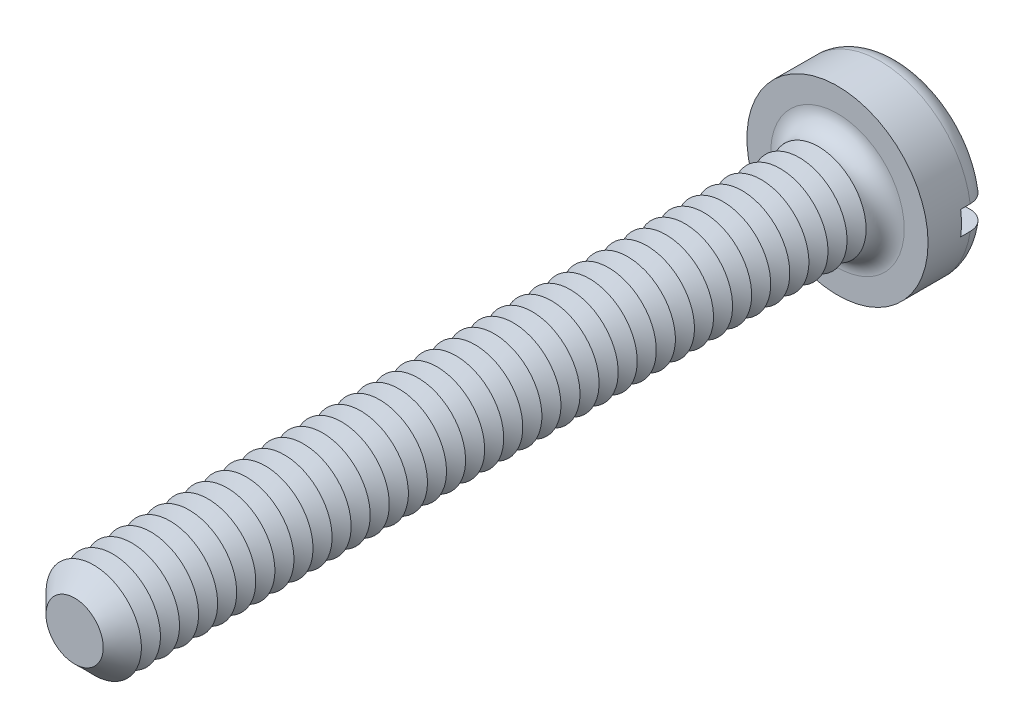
ISO-10303-21;
HEADER;
FILE_DESCRIPTION(('STEP AP214'),'2;1');
FILE_NAME('part.step','',(''),(''),'','','');
FILE_SCHEMA(('AUTOMOTIVE_DESIGN { 1 0 10303 214 1 1 1 1 }'));
ENDSEC;
DATA;
#1=APPLICATION_CONTEXT('core data for automotive mechanical design processes');
#2=APPLICATION_PROTOCOL_DEFINITION('international standard','automotive_design',2000,#1);
#3=PRODUCT_CONTEXT('',#1,'mechanical');
#4=PRODUCT('Part','Part','',(#3));
#5=PRODUCT_RELATED_PRODUCT_CATEGORY('part','',(#4));
#6=PRODUCT_DEFINITION_FORMATION('','',#4);
#7=PRODUCT_DEFINITION_CONTEXT('part definition',#1,'design');
#8=PRODUCT_DEFINITION('design','',#6,#7);
#9=PRODUCT_DEFINITION_SHAPE('','',#8);
#10=(LENGTH_UNIT() NAMED_UNIT(*) SI_UNIT(.MILLI.,.METRE.));
#11=(NAMED_UNIT(*) PLANE_ANGLE_UNIT() SI_UNIT($,.RADIAN.));
#12=(NAMED_UNIT(*) SI_UNIT($,.STERADIAN.) SOLID_ANGLE_UNIT());
#13=UNCERTAINTY_MEASURE_WITH_UNIT(LENGTH_MEASURE(1.E-05),#10,'distance_accuracy_value','');
#14=(GEOMETRIC_REPRESENTATION_CONTEXT(3) GLOBAL_UNCERTAINTY_ASSIGNED_CONTEXT((#13)) GLOBAL_UNIT_ASSIGNED_CONTEXT((#10,
#11,#12)) REPRESENTATION_CONTEXT('',''));
#15=CARTESIAN_POINT('',(0.,0.,0.));
#16=DIRECTION('',(0.,0.,1.));
#17=DIRECTION('',(1.,0.,0.));
#18=AXIS2_PLACEMENT_3D('',#15,#16,#17);
#19=CARTESIAN_POINT('',(0.,0.,-1.3));
#20=DIRECTION('',(0.,0.,1.));
#21=DIRECTION('',(1.,0.,0.));
#22=AXIS2_PLACEMENT_3D('',#19,#20,#21);
#23=PLANE('',#22);
#24=CARTESIAN_POINT('',(0.,0.,-1.3));
#25=DIRECTION('',(0.,0.,1.));
#26=DIRECTION('',(1.,0.,0.));
#27=AXIS2_PLACEMENT_3D('',#24,#25,#26);
#28=CIRCLE('',#27,1.5);
#29=CARTESIAN_POINT('',(-1.4790199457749,0.25,-1.3));
#30=VERTEX_POINT('',#29);
#31=CARTESIAN_POINT('',(1.4790199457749,0.25,-1.3));
#32=VERTEX_POINT('',#31);
#33=EDGE_CURVE('E116',#30,#32,#28,.F.);
#34=ORIENTED_EDGE('',*,*,#33,.T.);
#35=DIRECTION('',(1.,0.,0.));
#36=VECTOR('',#35,1.);
#37=CARTESIAN_POINT('',(-1.9,0.25,-1.3));
#38=LINE('',#37,#36);
#39=EDGE_CURVE('E111',#30,#32,#38,.T.);
#40=ORIENTED_EDGE('',*,*,#39,.F.);
#41=EDGE_LOOP('',(#34,#40));
#42=FACE_BOUND('',#41,.T.);
#43=ADVANCED_FACE('F39',(#42),#23,.F.);
#44=CARTESIAN_POINT('',(0.,0.,-0.9));
#45=DIRECTION('',(0.,0.,1.));
#46=DIRECTION('',(1.,0.,0.));
#47=AXIS2_PLACEMENT_3D('',#44,#45,#46);
#48=TOROIDAL_SURFACE('',#47,1.5,0.4);
#49=CARTESIAN_POINT('',(-1.8150392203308,0.25,-1.12284384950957));
#50=CARTESIAN_POINT('',(-1.80236980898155,0.25,-1.14155059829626));
#51=CARTESIAN_POINT('',(-1.78809920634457,0.25,-1.15919399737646));
#52=CARTESIAN_POINT('',(-1.75677844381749,0.25,-1.19184073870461));
#53=CARTESIAN_POINT('',(-1.73972468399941,0.25,-1.20684060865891));
#54=CARTESIAN_POINT('',(-1.70336024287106,0.25,-1.23375848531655));
#55=CARTESIAN_POINT('',(-1.68405164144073,0.25,-1.24567930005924));
#56=CARTESIAN_POINT('',(-1.64372549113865,0.25,-1.26613528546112));
#57=CARTESIAN_POINT('',(-1.6227083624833,0.25,-1.27467128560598));
#58=CARTESIAN_POINT('',(-1.57937988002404,0.25,-1.2881995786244));
#59=CARTESIAN_POINT('',(-1.55705957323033,0.25,-1.29316318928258));
#60=CARTESIAN_POINT('',(-1.51190394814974,0.25,-1.29931753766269));
#61=CARTESIAN_POINT('',(-1.48906857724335,0.25,-1.3005078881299));
#62=CARTESIAN_POINT('',(-1.4432641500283,0.25,-1.29909058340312));
#63=CARTESIAN_POINT('',(-1.42029638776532,0.25,-1.29644099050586));
#64=CARTESIAN_POINT('',(-1.37512297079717,0.25,-1.28735146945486));
#65=CARTESIAN_POINT('',(-1.3529173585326,0.25,-1.28091133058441));
#66=CARTESIAN_POINT('',(-1.30974098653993,0.25,-1.26436295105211));
#67=CARTESIAN_POINT('',(-1.28877978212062,0.25,-1.25422975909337));
#68=CARTESIAN_POINT('',(-1.24886205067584,0.25,-1.23057736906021));
#69=CARTESIAN_POINT('',(-1.22990554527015,0.25,-1.21705813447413));
#70=CARTESIAN_POINT('',(-1.19461911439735,0.25,-1.18704970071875));
#71=CARTESIAN_POINT('',(-1.17828051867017,0.25,-1.17057070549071));
#72=CARTESIAN_POINT('',(-1.14865897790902,0.25,-1.13506201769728));
#73=CARTESIAN_POINT('',(-1.13537576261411,0.25,-1.11603255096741));
#74=CARTESIAN_POINT('',(-1.11249827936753,0.25,-1.07630328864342));
#75=CARTESIAN_POINT('',(-1.10284494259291,0.25,-1.05563752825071));
#76=CARTESIAN_POINT('',(-1.08724024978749,0.25,-1.01295282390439));
#77=CARTESIAN_POINT('',(-1.08128829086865,0.25,-0.990934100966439));
#78=CARTESIAN_POINT('',(-1.07339124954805,0.25,-0.946722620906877));
#79=CARTESIAN_POINT('',(-1.07135558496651,0.25,-0.924546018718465));
#80=CARTESIAN_POINT('',(-1.07108722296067,0.25,-0.880170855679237));
#81=CARTESIAN_POINT('',(-1.07285419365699,0.25,-0.857972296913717));
#82=CARTESIAN_POINT('',(-1.0800838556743,0.25,-0.814463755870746));
#83=CARTESIAN_POINT('',(-1.08550159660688,0.25,-0.793146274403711));
#84=CARTESIAN_POINT('',(-1.09980522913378,0.25,-0.751709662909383));
#85=CARTESIAN_POINT('',(-1.10869126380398,0.25,-0.731590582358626));
#86=CARTESIAN_POINT('',(-1.12975121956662,0.25,-0.692901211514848));
#87=CARTESIAN_POINT('',(-1.14195627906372,0.25,-0.674347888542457));
#88=CARTESIAN_POINT('',(-1.1692428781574,0.25,-0.639494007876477));
#89=CARTESIAN_POINT('',(-1.18432473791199,0.25,-0.623193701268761));
#90=CARTESIAN_POINT('',(-1.21730350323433,0.25,-0.592916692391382));
#91=CARTESIAN_POINT('',(-1.23525650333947,0.25,-0.579001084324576));
#92=CARTESIAN_POINT('',(-1.27320799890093,0.25,-0.554314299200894));
#93=CARTESIAN_POINT('',(-1.2932067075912,0.25,-0.543543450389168));
#94=CARTESIAN_POINT('',(-1.33509120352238,0.25,-0.525253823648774));
#95=CARTESIAN_POINT('',(-1.35700545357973,0.25,-0.517800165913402));
#96=CARTESIAN_POINT('',(-1.401770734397,0.25,-0.506652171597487));
#97=CARTESIAN_POINT('',(-1.42462180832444,0.25,-0.502958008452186));
#98=CARTESIAN_POINT('',(-1.4707602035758,0.25,-0.499429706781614));
#99=CARTESIAN_POINT('',(-1.49404932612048,0.25,-0.499619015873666));
#100=CARTESIAN_POINT('',(-1.54026206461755,0.25,-0.50392615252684));
#101=CARTESIAN_POINT('',(-1.56318568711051,0.25,-0.508043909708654));
#102=CARTESIAN_POINT('',(-1.60788420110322,0.25,-0.520077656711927));
#103=CARTESIAN_POINT('',(-1.6296645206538,0.25,-0.527973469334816));
#104=CARTESIAN_POINT('',(-1.67156889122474,0.25,-0.547348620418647));
#105=CARTESIAN_POINT('',(-1.69169302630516,0.25,-0.558827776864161));
#106=CARTESIAN_POINT('',(-1.72948251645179,0.25,-0.584913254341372));
#107=CARTESIAN_POINT('',(-1.74717189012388,0.25,-0.599484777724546));
#108=CARTESIAN_POINT('',(-1.77981909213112,0.25,-0.63142070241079));
#109=CARTESIAN_POINT('',(-1.79477707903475,0.25,-0.648784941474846));
#110=CARTESIAN_POINT('',(-1.82136524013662,0.25,-0.685607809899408));
#111=CARTESIAN_POINT('',(-1.83303003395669,0.25,-0.705041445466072));
#112=CARTESIAN_POINT('',(-1.85289960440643,0.25,-0.745602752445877));
#113=CARTESIAN_POINT('',(-1.86110468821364,0.25,-0.76673027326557));
#114=CARTESIAN_POINT('',(-1.87375648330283,0.25,-0.809891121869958));
#115=CARTESIAN_POINT('',(-1.87823381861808,0.25,-0.831915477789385));
#116=CARTESIAN_POINT('',(-1.88341152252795,0.25,-0.87640983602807));
#117=CARTESIAN_POINT('',(-1.88411103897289,0.25,-0.898879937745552));
#118=CARTESIAN_POINT('',(-1.88171559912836,0.25,-0.943534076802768));
#119=CARTESIAN_POINT('',(-1.87863413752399,0.25,-0.965718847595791));
#120=CARTESIAN_POINT('',(-1.86879153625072,0.25,-1.00923650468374));
#121=CARTESIAN_POINT('',(-1.86203494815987,0.25,-1.03057040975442));
#122=CARTESIAN_POINT('',(-1.84837477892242,0.25,-1.06373797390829));
#123=CARTESIAN_POINT('',(-1.84255723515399,0.25,-1.07603047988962));
#124=CARTESIAN_POINT('',(-1.82969924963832,0.25,-1.09995814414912));
#125=CARTESIAN_POINT('',(-1.82265881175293,0.25,-1.11159330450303));
#126=CARTESIAN_POINT('',(-1.8150392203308,0.25,-1.12284384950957));
#127=B_SPLINE_CURVE_WITH_KNOTS('',3,(#49,#50,#51,#52,#53,#54,#55,#56,#57,#58,#59,#60,#61,#62,
#63,#64,#65,#66,#67,#68,#69,#70,#71,#72,#73,#74,#75,#76,#77,#78,#79,#80,#81,#82,#83,#84,#85,#86,
#87,#88,#89,#90,#91,#92,#93,#94,#95,#96,#97,#98,#99,#100,#101,#102,#103,#104,#105,#106,#107,
#108,#109,#110,#111,#112,#113,#114,#115,#116,#117,#118,#119,#120,#121,#122,#123,#124,#125,#126),
.UNSPECIFIED.,.T.,.F.,(4,2,2,2,2,2,2,2,2,2,2,2,2,2,2,2,2,2,2,2,2,2,2,2,2,2,2,2,2,2,2,2,2,2,2,2,
2,2,4),(0.,0.0677296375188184,0.135547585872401,0.203303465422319,0.27104273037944,
0.339319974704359,0.407604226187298,0.47663988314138,0.545679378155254,0.615194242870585,
0.684709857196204,0.753990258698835,0.82326452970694,0.891356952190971,0.959438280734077,
1.02592503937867,1.0924059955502,1.15808300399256,1.2237627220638,1.29008126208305,
1.35640718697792,1.4242376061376,1.49207510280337,1.5611911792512,1.63031044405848,
1.69984715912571,1.76938262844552,1.8385508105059,1.90771547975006,1.97613962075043,
2.04455978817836,2.11223135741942,2.17989691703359,2.24700094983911,2.31412011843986,
2.38100042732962,2.44779809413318,2.48853193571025,2.52926564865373),.UNSPECIFIED.);
#128=CARTESIAN_POINT('',(-1.88348082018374,0.25,-0.9));
#129=VERTEX_POINT('',#128);
#130=EDGE_CURVE('E483',#129,#30,#127,.T.);
#131=ORIENTED_EDGE('',*,*,#130,.F.);
#132=CARTESIAN_POINT('',(0.,0.,-0.9));
#133=DIRECTION('',(0.,0.,1.));
#134=DIRECTION('',(1.,0.,0.));
#135=AXIS2_PLACEMENT_3D('',#132,#133,#134);
#136=CIRCLE('',#135,1.9);
#137=CARTESIAN_POINT('',(1.88348082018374,0.25,-0.9));
#138=VERTEX_POINT('',#137);
#139=EDGE_CURVE('E125',#138,#129,#136,.T.);
#140=ORIENTED_EDGE('',*,*,#139,.F.);
#141=CARTESIAN_POINT('',(1.11362660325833,0.25,-1.07710243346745));
#142=CARTESIAN_POINT('',(1.12388366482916,0.25,-1.09736755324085));
#143=CARTESIAN_POINT('',(1.13589127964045,0.25,-1.11676768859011));
#144=CARTESIAN_POINT('',(1.16301945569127,0.25,-1.15328107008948));
#145=CARTESIAN_POINT('',(1.17814463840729,0.25,-1.17039085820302));
#146=CARTESIAN_POINT('',(1.21101661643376,0.25,-1.20182395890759));
#147=CARTESIAN_POINT('',(1.22875976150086,0.25,-1.21615108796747));
#148=CARTESIAN_POINT('',(1.26636392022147,0.25,-1.24166932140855));
#149=CARTESIAN_POINT('',(1.28622436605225,0.25,-1.25286126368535));
#150=CARTESIAN_POINT('',(1.32781377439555,0.25,-1.27196191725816));
#151=CARTESIAN_POINT('',(1.34956550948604,0.25,-1.27982107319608));
#152=CARTESIAN_POINT('',(1.39407620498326,0.25,-1.29180513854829));
#153=CARTESIAN_POINT('',(1.41683526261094,0.25,-1.29592968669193));
#154=CARTESIAN_POINT('',(1.46288034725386,0.25,-1.3003367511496));
#155=CARTESIAN_POINT('',(1.48616890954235,0.25,-1.30059287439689));
#156=CARTESIAN_POINT('',(1.53245605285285,0.25,-1.29717239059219));
#157=CARTESIAN_POINT('',(1.55545463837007,0.25,-1.29349584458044));
#158=CARTESIAN_POINT('',(1.60038828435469,0.25,-1.28232271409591));
#159=CARTESIAN_POINT('',(1.62232790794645,0.25,-1.27484449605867));
#160=CARTESIAN_POINT('',(1.66461970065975,0.25,-1.25627203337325));
#161=CARTESIAN_POINT('',(1.68497195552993,0.25,-1.24517798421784));
#162=CARTESIAN_POINT('',(1.72328060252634,0.25,-1.21981269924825));
#163=CARTESIAN_POINT('',(1.74126001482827,0.25,-1.2055762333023));
#164=CARTESIAN_POINT('',(1.77453973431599,0.25,-1.17425606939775));
#165=CARTESIAN_POINT('',(1.78984019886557,0.25,-1.1571725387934));
#166=CARTESIAN_POINT('',(1.81715014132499,0.25,-1.12084732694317));
#167=CARTESIAN_POINT('',(1.82919410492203,0.25,-1.10163156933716));
#168=CARTESIAN_POINT('',(1.84985315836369,0.25,-1.06143759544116));
#169=CARTESIAN_POINT('',(1.85846842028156,0.25,-1.04045946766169));
#170=CARTESIAN_POINT('',(1.87195437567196,0.25,-0.997526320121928));
#171=CARTESIAN_POINT('',(1.87685590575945,0.25,-0.975580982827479));
#172=CARTESIAN_POINT('',(1.88288741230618,0.25,-0.931178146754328));
#173=CARTESIAN_POINT('',(1.88401750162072,0.25,-0.908720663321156));
#174=CARTESIAN_POINT('',(1.88247598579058,0.25,-0.864033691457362));
#175=CARTESIAN_POINT('',(1.87982069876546,0.25,-0.841803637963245));
#176=CARTESIAN_POINT('',(1.87081646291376,0.25,-0.798104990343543));
#177=CARTESIAN_POINT('',(1.86446754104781,0.25,-0.776636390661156));
#178=CARTESIAN_POINT('',(1.84826063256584,0.25,-0.735060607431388));
#179=CARTESIAN_POINT('',(1.83840161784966,0.25,-0.714953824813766));
#180=CARTESIAN_POINT('',(1.81546327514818,0.25,-0.676670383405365));
#181=CARTESIAN_POINT('',(1.80238389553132,0.25,-0.658493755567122));
#182=CARTESIAN_POINT('',(1.77331327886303,0.25,-0.62448916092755));
#183=CARTESIAN_POINT('',(1.75730833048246,0.25,-0.608672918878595));
#184=CARTESIAN_POINT('',(1.72289038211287,0.25,-0.579924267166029));
#185=CARTESIAN_POINT('',(1.70447729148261,0.25,-0.566991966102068));
#186=CARTESIAN_POINT('',(1.66559643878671,0.25,-0.544254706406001));
#187=CARTESIAN_POINT('',(1.64511218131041,0.25,-0.53447796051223));
#188=CARTESIAN_POINT('',(1.60280554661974,0.25,-0.518459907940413));
#189=CARTESIAN_POINT('',(1.58098309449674,0.25,-0.512218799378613));
#190=CARTESIAN_POINT('',(1.53636184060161,0.25,-0.503375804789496));
#191=CARTESIAN_POINT('',(1.51355490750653,0.25,-0.500814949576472));
#192=CARTESIAN_POINT('',(1.46783245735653,0.25,-0.499516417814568));
#193=CARTESIAN_POINT('',(1.44491693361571,0.25,-0.500778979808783));
#194=CARTESIAN_POINT('',(1.39937748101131,0.25,-0.50711284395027));
#195=CARTESIAN_POINT('',(1.37675897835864,0.25,-0.512223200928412));
#196=CARTESIAN_POINT('',(1.33269286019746,0.25,-0.526151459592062));
#197=CARTESIAN_POINT('',(1.31124530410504,0.25,-0.534969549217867));
#198=CARTESIAN_POINT('',(1.27004097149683,0.25,-0.556118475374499));
#199=CARTESIAN_POINT('',(1.25029179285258,0.25,-0.568464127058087));
#200=CARTESIAN_POINT('',(1.21316554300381,0.25,-0.59631968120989));
#201=CARTESIAN_POINT('',(1.19578844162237,0.25,-0.611829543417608));
#202=CARTESIAN_POINT('',(1.16406059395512,0.25,-0.645459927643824));
#203=CARTESIAN_POINT('',(1.14968747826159,0.25,-0.663559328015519));
#204=CARTESIAN_POINT('',(1.12425968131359,0.25,-0.70195566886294));
#205=CARTESIAN_POINT('',(1.11320445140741,0.25,-0.722252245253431));
#206=CARTESIAN_POINT('',(1.09497726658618,0.25,-0.764020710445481));
#207=CARTESIAN_POINT('',(1.08772970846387,0.25,-0.785459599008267));
#208=CARTESIAN_POINT('',(1.07702618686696,0.25,-0.829269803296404));
#209=CARTESIAN_POINT('',(1.07357062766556,0.25,-0.851641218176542));
#210=CARTESIAN_POINT('',(1.07060826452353,0.25,-0.896160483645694));
#211=CARTESIAN_POINT('',(1.07101876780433,0.25,-0.918302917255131));
#212=CARTESIAN_POINT('',(1.07557730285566,0.25,-0.962179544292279));
#213=CARTESIAN_POINT('',(1.07972048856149,0.25,-0.983914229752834));
#214=CARTESIAN_POINT('',(1.08912066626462,0.25,-1.01754924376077));
#215=CARTESIAN_POINT('',(1.09320341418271,0.25,-1.02979035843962));
#216=CARTESIAN_POINT('',(1.10254493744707,0.25,-1.05381470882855));
#217=CARTESIAN_POINT('',(1.10780368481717,0.25,-1.06559795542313));
#218=CARTESIAN_POINT('',(1.11362660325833,0.25,-1.07710243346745));
#219=B_SPLINE_CURVE_WITH_KNOTS('',3,(#141,#142,#143,#144,#145,#146,#147,#148,#149,#150,#151,
#152,#153,#154,#155,#156,#157,#158,#159,#160,#161,#162,#163,#164,#165,#166,#167,#168,#169,#170,
#171,#172,#173,#174,#175,#176,#177,#178,#179,#180,#181,#182,#183,#184,#185,#186,#187,#188,#189,
#190,#191,#192,#193,#194,#195,#196,#197,#198,#199,#200,#201,#202,#203,#204,#205,#206,#207,#208,
#209,#210,#211,#212,#213,#214,#215,#216,#217,#218),.UNSPECIFIED.,.T.,.F.,(4,2,2,2,2,2,2,2,2,2,2,
2,2,2,2,2,2,2,2,2,2,2,2,2,2,2,2,2,2,2,2,2,2,2,2,2,2,2,4),(0.,0.0680907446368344,
0.136283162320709,0.204381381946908,0.272461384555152,0.341520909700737,0.410587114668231,
0.480124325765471,0.549660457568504,0.618863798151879,0.688063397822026,0.756532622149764,
0.824997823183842,0.892706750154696,0.960412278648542,1.02754926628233,1.09468424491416,
1.16153068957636,1.22837664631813,1.29524219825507,1.36210882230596,1.42929726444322,
1.49648823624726,1.56426429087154,1.63204414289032,1.70057395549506,1.76910804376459,
1.83834728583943,1.90759003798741,1.97712798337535,2.0466650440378,2.11566422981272,
2.18465199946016,2.25221259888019,2.3197804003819,2.38590630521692,2.45194648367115,
2.49060241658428,2.5292574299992),.UNSPECIFIED.);
#220=EDGE_CURVE('E485',#32,#138,#219,.T.);
#221=ORIENTED_EDGE('',*,*,#220,.F.);
#222=ORIENTED_EDGE('',*,*,#33,.F.);
#223=EDGE_LOOP('',(#131,#140,#221,#222));
#224=FACE_BOUND('',#223,.T.);
#225=ADVANCED_FACE('F467',(#224),#48,.T.);
#226=CARTESIAN_POINT('',(0.,0.,-1.3));
#227=DIRECTION('',(0.,0.,1.));
#228=DIRECTION('',(1.,0.,0.));
#229=AXIS2_PLACEMENT_3D('',#226,#227,#228);
#230=CYLINDRICAL_SURFACE('',#229,1.9);
#231=DIRECTION('',(0.,0.,1.));
#232=VECTOR('',#231,1.);
#233=CARTESIAN_POINT('',(1.88348082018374,0.25,-1.3));
#234=LINE('',#233,#232);
#235=CARTESIAN_POINT('',(1.88348082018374,0.25,-0.7));
#236=VERTEX_POINT('',#235);
#237=EDGE_CURVE('E501',#138,#236,#234,.T.);
#238=ORIENTED_EDGE('',*,*,#237,.F.);
#239=ORIENTED_EDGE('',*,*,#139,.T.);
#240=DIRECTION('',(0.,0.,1.));
#241=VECTOR('',#240,1.);
#242=CARTESIAN_POINT('',(-1.88348082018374,0.25,-1.3));
#243=LINE('',#242,#241);
#244=CARTESIAN_POINT('',(-1.88348082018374,0.25,-0.7));
#245=VERTEX_POINT('',#244);
#246=EDGE_CURVE('E63',#245,#129,#243,.F.);
#247=ORIENTED_EDGE('',*,*,#246,.F.);
#248=CARTESIAN_POINT('',(0.,0.,-0.7));
#249=DIRECTION('',(0.,0.,-1.));
#250=DIRECTION('',(-1.,0.,0.));
#251=AXIS2_PLACEMENT_3D('',#248,#249,#250);
#252=CIRCLE('',#251,1.9);
#253=CARTESIAN_POINT('',(-1.88348082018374,-0.25,-0.7));
#254=VERTEX_POINT('',#253);
#255=EDGE_CURVE('E43',#245,#254,#252,.F.);
#256=ORIENTED_EDGE('',*,*,#255,.T.);
#257=DIRECTION('',(0.,0.,1.));
#258=VECTOR('',#257,1.);
#259=CARTESIAN_POINT('',(-1.88348082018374,-0.25,-1.3));
#260=LINE('',#259,#258);
#261=CARTESIAN_POINT('',(-1.88348082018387,-0.25,-0.899999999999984));
#262=VERTEX_POINT('',#261);
#263=EDGE_CURVE('E498',#262,#254,#260,.T.);
#264=ORIENTED_EDGE('',*,*,#263,.F.);
#265=CARTESIAN_POINT('',(1.88348082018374,-0.25,-0.9));
#266=VERTEX_POINT('',#265);
#267=EDGE_CURVE('E127',#262,#266,#136,.T.);
#268=ORIENTED_EDGE('',*,*,#267,.T.);
#269=DIRECTION('',(0.,0.,1.));
#270=VECTOR('',#269,1.);
#271=CARTESIAN_POINT('',(1.88348082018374,-0.25,-1.3));
#272=LINE('',#271,#270);
#273=CARTESIAN_POINT('',(1.88348082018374,-0.25,-0.7));
#274=VERTEX_POINT('',#273);
#275=EDGE_CURVE('E55',#274,#266,#272,.F.);
#276=ORIENTED_EDGE('',*,*,#275,.F.);
#277=EDGE_CURVE('E11',#274,#236,#252,.F.);
#278=ORIENTED_EDGE('',*,*,#277,.T.);
#279=EDGE_LOOP('',(#238,#239,#247,#256,#264,#268,#276,#278));
#280=FACE_BOUND('',#279,.T.);
#281=CARTESIAN_POINT('',(0.,0.,0.));
#282=DIRECTION('',(0.,0.,1.));
#283=DIRECTION('',(1.,0.,0.));
#284=AXIS2_PLACEMENT_3D('',#281,#282,#283);
#285=CIRCLE('',#284,1.9);
#286=CARTESIAN_POINT('',(1.9,0.,0.));
#287=VERTEX_POINT('',#286);
#288=EDGE_CURVE('E504',#287,#287,#285,.T.);
#289=ORIENTED_EDGE('',*,*,#288,.F.);
#290=EDGE_LOOP('',(#289));
#291=FACE_BOUND('',#290,.T.);
#292=ADVANCED_FACE('F463',(#280,#291),#230,.T.);
#293=CARTESIAN_POINT('',(1.4790199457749,-0.25,-1.3));
#294=VERTEX_POINT('',#293);
#295=CARTESIAN_POINT('',(-1.4790199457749,-0.25,-1.3));
#296=VERTEX_POINT('',#295);
#297=EDGE_CURVE('E109',#294,#296,#28,.F.);
#298=ORIENTED_EDGE('',*,*,#297,.T.);
#299=DIRECTION('',(-1.,0.,0.));
#300=VECTOR('',#299,1.);
#301=CARTESIAN_POINT('',(-1.9,-0.25,-1.3));
#302=LINE('',#301,#300);
#303=EDGE_CURVE('E96',#294,#296,#302,.T.);
#304=ORIENTED_EDGE('',*,*,#303,.F.);
#305=EDGE_LOOP('',(#298,#304));
#306=FACE_BOUND('',#305,.T.);
#307=ADVANCED_FACE('F108',(#306),#23,.F.);
#308=CARTESIAN_POINT('',(0.,0.,0.));
#309=DIRECTION('',(0.,0.,1.));
#310=DIRECTION('',(1.,0.,0.));
#311=AXIS2_PLACEMENT_3D('',#308,#309,#310);
#312=PLANE('',#311);
#313=CARTESIAN_POINT('',(0.,0.,0.));
#314=DIRECTION('',(0.,0.,1.));
#315=DIRECTION('',(1.,0.,0.));
#316=AXIS2_PLACEMENT_3D('',#313,#314,#315);
#317=CIRCLE('',#316,1.4);
#318=CARTESIAN_POINT('',(1.4,0.,0.));
#319=VERTEX_POINT('',#318);
#320=EDGE_CURVE('E115',#319,#319,#317,.F.);
#321=ORIENTED_EDGE('',*,*,#320,.T.);
#322=EDGE_LOOP('',(#321));
#323=FACE_BOUND('',#322,.T.);
#324=ORIENTED_EDGE('',*,*,#288,.T.);
#325=EDGE_LOOP('',(#324));
#326=FACE_BOUND('',#325,.T.);
#327=ADVANCED_FACE('F462',(#323,#326),#312,.T.);
#328=CARTESIAN_POINT('',(-1.8150392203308,-0.25,-1.12284384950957));
#329=CARTESIAN_POINT('',(-1.82756185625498,-0.25,-1.10435021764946));
#330=CARTESIAN_POINT('',(-1.83853807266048,-0.25,-1.08479072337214));
#331=CARTESIAN_POINT('',(-1.85706233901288,-0.25,-1.04409188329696));
#332=CARTESIAN_POINT('',(-1.86460655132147,-0.25,-1.02295079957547));
#333=CARTESIAN_POINT('',(-1.87603074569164,-0.25,-0.979704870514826));
#334=CARTESIAN_POINT('',(-1.87991177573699,-0.25,-0.957600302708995));
#335=CARTESIAN_POINT('',(-1.88389586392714,-0.25,-0.913058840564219));
#336=CARTESIAN_POINT('',(-1.88399981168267,-0.25,-0.890622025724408));
#337=CARTESIAN_POINT('',(-1.88043374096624,-0.25,-0.846104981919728));
#338=CARTESIAN_POINT('',(-1.87677281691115,-0.25,-0.824024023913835));
#339=CARTESIAN_POINT('',(-1.86579880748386,-0.25,-0.780788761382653));
#340=CARTESIAN_POINT('',(-1.85848560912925,-0.25,-0.759634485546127));
#341=CARTESIAN_POINT('',(-1.8404137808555,-0.25,-0.718830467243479));
#342=CARTESIAN_POINT('',(-1.82965205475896,-0.25,-0.699182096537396));
#343=CARTESIAN_POINT('',(-1.80499939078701,-0.25,-0.661958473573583));
#344=CARTESIAN_POINT('',(-1.7911083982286,-0.25,-0.644383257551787));
#345=CARTESIAN_POINT('',(-1.76051564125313,-0.25,-0.611699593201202));
#346=CARTESIAN_POINT('',(-1.74379913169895,-0.25,-0.596604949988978));
#347=CARTESIAN_POINT('',(-1.70808901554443,-0.25,-0.569406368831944));
#348=CARTESIAN_POINT('',(-1.68909532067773,-0.25,-0.557302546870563));
#349=CARTESIAN_POINT('',(-1.64918615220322,-0.25,-0.536307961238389));
#350=CARTESIAN_POINT('',(-1.62825469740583,-0.25,-0.527447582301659));
#351=CARTESIAN_POINT('',(-1.58521203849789,-0.25,-0.513323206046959));
#352=CARTESIAN_POINT('',(-1.5631007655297,-0.25,-0.508059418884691));
#353=CARTESIAN_POINT('',(-1.51806209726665,-0.25,-0.501215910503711));
#354=CARTESIAN_POINT('',(-1.4951283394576,-0.25,-0.499678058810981));
#355=CARTESIAN_POINT('',(-1.4493239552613,-0.25,-0.500434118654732));
#356=CARTESIAN_POINT('',(-1.4264533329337,-0.25,-0.502728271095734));
#357=CARTESIAN_POINT('',(-1.38118643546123,-0.25,-0.511115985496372));
#358=CARTESIAN_POINT('',(-1.35879703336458,-0.25,-0.51724667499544));
#359=CARTESIAN_POINT('',(-1.31535851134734,-0.25,-0.533167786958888));
#360=CARTESIAN_POINT('',(-1.29430945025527,-0.25,-0.542958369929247));
#361=CARTESIAN_POINT('',(-1.25409242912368,-0.25,-0.565968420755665));
#362=CARTESIAN_POINT('',(-1.23493023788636,-0.25,-0.579197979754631));
#363=CARTESIAN_POINT('',(-1.19912477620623,-0.25,-0.608715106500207));
#364=CARTESIAN_POINT('',(-1.18248143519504,-0.25,-0.625002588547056));
#365=CARTESIAN_POINT('',(-1.15237533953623,-0.25,-0.660018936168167));
#366=CARTESIAN_POINT('',(-1.13888343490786,-0.25,-0.678722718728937));
#367=CARTESIAN_POINT('',(-1.115312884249,-0.25,-0.718170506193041));
#368=CARTESIAN_POINT('',(-1.10523377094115,-0.25,-0.738914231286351));
#369=CARTESIAN_POINT('',(-1.08901310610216,-0.25,-0.781372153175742));
#370=CARTESIAN_POINT('',(-1.08279080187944,-0.25,-0.803055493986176));
#371=CARTESIAN_POINT('',(-1.07416105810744,-0.25,-0.847167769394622));
#372=CARTESIAN_POINT('',(-1.07175306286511,-0.25,-0.869596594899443));
#373=CARTESIAN_POINT('',(-1.07084656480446,-0.25,-0.914070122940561));
#374=CARTESIAN_POINT('',(-1.07226874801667,-0.25,-0.936113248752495));
#375=CARTESIAN_POINT('',(-1.07880428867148,-0.25,-0.979644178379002));
#376=CARTESIAN_POINT('',(-1.08391755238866,-0.25,-1.00113199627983));
#377=CARTESIAN_POINT('',(-1.09764616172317,-0.25,-1.04290115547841));
#378=CARTESIAN_POINT('',(-1.10625346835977,-0.25,-1.06318514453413));
#379=CARTESIAN_POINT('',(-1.12669365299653,-0.25,-1.10205584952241));
#380=CARTESIAN_POINT('',(-1.13852679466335,-0.25,-1.12064242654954));
#381=CARTESIAN_POINT('',(-1.16529672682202,-0.25,-1.15594801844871));
#382=CARTESIAN_POINT('',(-1.18028464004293,-0.25,-1.17262825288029));
#383=CARTESIAN_POINT('',(-1.21279183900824,-0.25,-1.20330600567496));
#384=CARTESIAN_POINT('',(-1.23031142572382,-0.25,-1.21730320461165));
#385=CARTESIAN_POINT('',(-1.26781695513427,-0.25,-1.24254670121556));
#386=CARTESIAN_POINT('',(-1.28784999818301,-0.25,-1.25372305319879));
#387=CARTESIAN_POINT('',(-1.3294899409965,-0.25,-1.27260611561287));
#388=CARTESIAN_POINT('',(-1.35109697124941,-0.25,-1.28031253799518));
#389=CARTESIAN_POINT('',(-1.39558575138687,-0.25,-1.29212626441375));
#390=CARTESIAN_POINT('',(-1.4184807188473,-0.25,-1.29618386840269));
#391=CARTESIAN_POINT('',(-1.4646266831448,-0.25,-1.30039947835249));
#392=CARTESIAN_POINT('',(-1.48787767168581,-0.25,-1.30055757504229));
#393=CARTESIAN_POINT('',(-1.53407883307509,-0.25,-1.29695468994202));
#394=CARTESIAN_POINT('',(-1.55702895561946,-0.25,-1.29319306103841));
#395=CARTESIAN_POINT('',(-1.60196718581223,-0.25,-1.28183520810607));
#396=CARTESIAN_POINT('',(-1.62395508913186,-0.25,-1.27423817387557));
#397=CARTESIAN_POINT('',(-1.66614393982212,-0.25,-1.25548646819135));
#398=CARTESIAN_POINT('',(-1.68635782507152,-0.25,-1.24436087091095));
#399=CARTESIAN_POINT('',(-1.72458266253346,-0.25,-1.21884344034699));
#400=CARTESIAN_POINT('',(-1.74259637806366,-0.25,-1.20445577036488));
#401=CARTESIAN_POINT('',(-1.76968989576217,-0.25,-1.1787247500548));
#402=CARTESIAN_POINT('',(-1.77959984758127,-0.25,-1.1682407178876));
#403=CARTESIAN_POINT('',(-1.79823423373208,-0.25,-1.14626700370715));
#404=CARTESIAN_POINT('',(-1.80695867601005,-0.25,-1.1347773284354));
#405=CARTESIAN_POINT('',(-1.8150392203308,-0.25,-1.12284384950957));
#406=B_SPLINE_CURVE_WITH_KNOTS('',3,(#328,#329,#330,#331,#332,#333,#334,#335,#336,#337,#338,
#339,#340,#341,#342,#343,#344,#345,#346,#347,#348,#349,#350,#351,#352,#353,#354,#355,#356,#357,
#358,#359,#360,#361,#362,#363,#364,#365,#366,#367,#368,#369,#370,#371,#372,#373,#374,#375,#376,
#377,#378,#379,#380,#381,#382,#383,#384,#385,#386,#387,#388,#389,#390,#391,#392,#393,#394,#395,
#396,#397,#398,#399,#400,#401,#402,#403,#404,#405),.UNSPECIFIED.,.T.,.F.,(4,2,2,2,2,2,2,2,2,2,2,
2,2,2,2,2,2,2,2,2,2,2,2,2,2,2,2,2,2,2,2,2,2,2,2,2,2,2,4),(0.,0.0669512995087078,
0.133977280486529,0.200984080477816,0.267975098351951,0.334804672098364,0.401636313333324,
0.468528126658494,0.535421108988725,0.602674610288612,0.669930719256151,0.737801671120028,
0.805676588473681,0.87431077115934,0.942949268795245,1.0122625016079,1.08157877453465,
1.15110078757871,1.22062085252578,1.28946987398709,1.35830946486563,1.42565417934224,
1.49298908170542,1.55894041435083,1.62489007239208,1.69068884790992,1.75649300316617,
1.82345932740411,1.89043361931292,1.95893391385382,2.02743989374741,2.09686543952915,
2.16628937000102,2.23572476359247,2.3051748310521,2.3740669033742,2.44287154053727,
2.48607383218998,2.52927583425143),.UNSPECIFIED.);
#407=EDGE_CURVE('E103',#296,#262,#406,.T.);
#408=ORIENTED_EDGE('',*,*,#407,.F.);
#409=ORIENTED_EDGE('',*,*,#297,.F.);
#410=CARTESIAN_POINT('',(1.11362660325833,-0.25,-1.07710243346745));
#411=CARTESIAN_POINT('',(1.10368387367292,-0.25,-1.05745397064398));
#412=CARTESIAN_POINT('',(1.09537204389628,-0.25,-1.0369644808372));
#413=CARTESIAN_POINT('',(1.08229212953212,-0.25,-0.994867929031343));
#414=CARTESIAN_POINT('',(1.07752732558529,-0.25,-0.973259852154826));
#415=CARTESIAN_POINT('',(1.07171197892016,-0.25,-0.929545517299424));
#416=CARTESIAN_POINT('',(1.07066166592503,-0.25,-0.907439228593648));
#417=CARTESIAN_POINT('',(1.07231382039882,-0.25,-0.863372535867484));
#418=CARTESIAN_POINT('',(1.07501551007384,-0.25,-0.841412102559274));
#419=CARTESIAN_POINT('',(1.08404966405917,-0.25,-0.798386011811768));
#420=CARTESIAN_POINT('',(1.09036099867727,-0.25,-0.777315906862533));
#421=CARTESIAN_POINT('',(1.10638973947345,-0.25,-0.736514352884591));
#422=CARTESIAN_POINT('',(1.11610743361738,-0.25,-0.716783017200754));
#423=CARTESIAN_POINT('',(1.13878208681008,-0.25,-0.678952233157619));
#424=CARTESIAN_POINT('',(1.15177705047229,-0.25,-0.660875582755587));
#425=CARTESIAN_POINT('',(1.18055347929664,-0.25,-0.62709692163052));
#426=CARTESIAN_POINT('',(1.19633525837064,-0.25,-0.611395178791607));
#427=CARTESIAN_POINT('',(1.23062926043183,-0.25,-0.582430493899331));
#428=CARTESIAN_POINT('',(1.24919608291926,-0.25,-0.569232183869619));
#429=CARTESIAN_POINT('',(1.28825118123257,-0.25,-0.546076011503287));
#430=CARTESIAN_POINT('',(1.30873964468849,-0.25,-0.536118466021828));
#431=CARTESIAN_POINT('',(1.35144534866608,-0.25,-0.519560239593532));
#432=CARTESIAN_POINT('',(1.3736865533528,-0.25,-0.513021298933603));
#433=CARTESIAN_POINT('',(1.41894945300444,-0.25,-0.503751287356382));
#434=CARTESIAN_POINT('',(1.44197117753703,-0.25,-0.50102036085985));
#435=CARTESIAN_POINT('',(1.48824913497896,-0.25,-0.499449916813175));
#436=CARTESIAN_POINT('',(1.5115059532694,-0.25,-0.500627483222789));
#437=CARTESIAN_POINT('',(1.55748678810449,-0.25,-0.506895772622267));
#438=CARTESIAN_POINT('',(1.58021081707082,-0.25,-0.511986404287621));
#439=CARTESIAN_POINT('',(1.6243247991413,-0.25,-0.525910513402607));
#440=CARTESIAN_POINT('',(1.64572225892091,-0.25,-0.534720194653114));
#441=CARTESIAN_POINT('',(1.68671060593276,-0.25,-0.555845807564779));
#442=CARTESIAN_POINT('',(1.70630159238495,-0.25,-0.568161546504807));
#443=CARTESIAN_POINT('',(1.74289060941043,-0.25,-0.595805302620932));
#444=CARTESIAN_POINT('',(1.75991474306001,-0.25,-0.611098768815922));
#445=CARTESIAN_POINT('',(1.79111916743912,-0.25,-0.644354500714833));
#446=CARTESIAN_POINT('',(1.80529962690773,-0.25,-0.662316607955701));
#447=CARTESIAN_POINT('',(1.83025525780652,-0.25,-0.700191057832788));
#448=CARTESIAN_POINT('',(1.84106535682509,-0.25,-0.720080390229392));
#449=CARTESIAN_POINT('',(1.8591630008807,-0.25,-0.761401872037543));
#450=CARTESIAN_POINT('',(1.86645070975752,-0.25,-0.782833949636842));
#451=CARTESIAN_POINT('',(1.87724305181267,-0.25,-0.826454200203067));
#452=CARTESIAN_POINT('',(1.88077646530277,-0.25,-0.848635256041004));
#453=CARTESIAN_POINT('',(1.88405487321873,-0.25,-0.89327539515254));
#454=CARTESIAN_POINT('',(1.88379996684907,-0.25,-0.915734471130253));
#455=CARTESIAN_POINT('',(1.87951702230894,-0.25,-0.96021054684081));
#456=CARTESIAN_POINT('',(1.87550211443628,-0.25,-0.982228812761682));
#457=CARTESIAN_POINT('',(1.86383665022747,-0.25,-1.0252797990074));
#458=CARTESIAN_POINT('',(1.85618610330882,-0.25,-1.04631252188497));
#459=CARTESIAN_POINT('',(1.83746332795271,-0.25,-1.08682395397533));
#460=CARTESIAN_POINT('',(1.82638722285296,-0.25,-1.10630087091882));
#461=CARTESIAN_POINT('',(1.80113946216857,-0.25,-1.14313202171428));
#462=CARTESIAN_POINT('',(1.78696774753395,-0.25,-1.1604862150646));
#463=CARTESIAN_POINT('',(1.75585044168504,-0.25,-1.19268694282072));
#464=CARTESIAN_POINT('',(1.73888979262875,-0.25,-1.20751892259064));
#465=CARTESIAN_POINT('',(1.7027387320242,-0.25,-1.23415579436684));
#466=CARTESIAN_POINT('',(1.68354822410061,-0.25,-1.24596055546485));
#467=CARTESIAN_POINT('',(1.64329341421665,-0.25,-1.26632784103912));
#468=CARTESIAN_POINT('',(1.62221336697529,-0.25,-1.27485924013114));
#469=CARTESIAN_POINT('',(1.5789301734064,-0.25,-1.28830571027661));
#470=CARTESIAN_POINT('',(1.55672695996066,-0.25,-1.29322056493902));
#471=CARTESIAN_POINT('',(1.5115614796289,-0.25,-1.29935191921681));
#472=CARTESIAN_POINT('',(1.4885934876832,-0.25,-1.30052625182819));
#473=CARTESIAN_POINT('',(1.44278240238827,-0.25,-1.2990417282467));
#474=CARTESIAN_POINT('',(1.41993931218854,-0.25,-1.29638277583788));
#475=CARTESIAN_POINT('',(1.37479511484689,-0.25,-1.28727159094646));
#476=CARTESIAN_POINT('',(1.35250125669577,-0.25,-1.2807834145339));
#477=CARTESIAN_POINT('',(1.30930729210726,-0.25,-1.2641644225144));
#478=CARTESIAN_POINT('',(1.2884075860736,-0.25,-1.25403256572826));
#479=CARTESIAN_POINT('',(1.24854853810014,-0.25,-1.23036781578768));
#480=CARTESIAN_POINT('',(1.22959511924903,-0.25,-1.21682495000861));
#481=CARTESIAN_POINT('',(1.19427766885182,-0.25,-1.18672803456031));
#482=CARTESIAN_POINT('',(1.17791048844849,-0.25,-1.170177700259));
#483=CARTESIAN_POINT('',(1.15346856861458,-0.25,-1.14079355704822));
#484=CARTESIAN_POINT('',(1.14449891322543,-0.25,-1.12869247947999));
#485=CARTESIAN_POINT('',(1.12797460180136,-0.25,-1.10355927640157));
#486=CARTESIAN_POINT('',(1.1204199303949,-0.25,-1.09052716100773));
#487=CARTESIAN_POINT('',(1.11362660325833,-0.25,-1.07710243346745));
#488=B_SPLINE_CURVE_WITH_KNOTS('',3,(#410,#411,#412,#413,#414,#415,#416,#417,#418,#419,#420,
#421,#422,#423,#424,#425,#426,#427,#428,#429,#430,#431,#432,#433,#434,#435,#436,#437,#438,#439,
#440,#441,#442,#443,#444,#445,#446,#447,#448,#449,#450,#451,#452,#453,#454,#455,#456,#457,#458,
#459,#460,#461,#462,#463,#464,#465,#466,#467,#468,#469,#470,#471,#472,#473,#474,#475,#476,#477,
#478,#479,#480,#481,#482,#483,#484,#485,#486,#487),.UNSPECIFIED.,.T.,.F.,(4,2,2,2,2,2,2,2,2,2,2,
2,2,2,2,2,2,2,2,2,2,2,2,2,2,2,2,2,2,2,2,2,2,2,2,2,2,2,4),(0.,0.0660089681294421,
0.132078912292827,0.198152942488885,0.26421327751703,0.329890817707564,0.395573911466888,
0.462056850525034,0.528547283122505,0.596571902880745,0.664603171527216,0.733823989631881,
0.803047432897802,0.872573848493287,0.94209864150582,1.01118516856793,1.08026789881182,
1.14859228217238,1.21691261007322,1.28449938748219,1.35208302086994,1.41914473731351,
1.48620469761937,1.55303134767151,1.61985782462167,1.68676020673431,1.75366386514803,
1.82094137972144,1.88822180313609,1.95612699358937,2.0240362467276,2.09270838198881,
2.16138224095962,2.23071121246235,2.30006001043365,2.36961396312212,2.4390825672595,
2.48418340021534,2.52928374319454),.UNSPECIFIED.);
#489=EDGE_CURVE('E92',#266,#294,#488,.T.);
#490=ORIENTED_EDGE('',*,*,#489,.F.);
#491=ORIENTED_EDGE('',*,*,#267,.F.);
#492=EDGE_LOOP('',(#408,#409,#490,#491));
#493=FACE_BOUND('',#492,.T.);
#494=ADVANCED_FACE('F113',(#493),#48,.T.);
#495=CARTESIAN_POINT('',(0.,0.,0.399999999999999));
#496=DIRECTION('',(0.,0.,1.));
#497=DIRECTION('',(1.,0.,0.));
#498=AXIS2_PLACEMENT_3D('',#495,#496,#497);
#499=TOROIDAL_SURFACE('',#498,1.4,0.4);
#500=ORIENTED_EDGE('',*,*,#320,.F.);
#501=EDGE_LOOP('',(#500));
#502=FACE_BOUND('',#501,.T.);
#503=CARTESIAN_POINT('',(0.,0.,0.399999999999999));
#504=DIRECTION('',(0.,0.,-1.));
#505=DIRECTION('',(-1.,0.,0.));
#506=AXIS2_PLACEMENT_3D('',#503,#504,#505);
#507=CIRCLE('',#506,1.);
#508=CARTESIAN_POINT('',(-1.,0.,0.399999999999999));
#509=VERTEX_POINT('',#508);
#510=EDGE_CURVE('E510',#509,#509,#507,.T.);
#511=ORIENTED_EDGE('',*,*,#510,.T.);
#512=EDGE_LOOP('',(#511));
#513=FACE_BOUND('',#512,.T.);
#514=ADVANCED_FACE('F455',(#502,#513),#499,.F.);
#515=CARTESIAN_POINT('',(0.,0.,0.599999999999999));
#516=DIRECTION('',(0.,0.,-1.));
#517=DIRECTION('',(-1.,0.,0.));
#518=AXIS2_PLACEMENT_3D('',#515,#516,#517);
#519=CONICAL_SURFACE('',#518,0.653589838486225,1.0471975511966);
#520=ORIENTED_EDGE('',*,*,#510,.F.);
#521=EDGE_LOOP('',(#520));
#522=FACE_BOUND('',#521,.T.);
#523=CARTESIAN_POINT('',(0.,0.,0.599999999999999));
#524=DIRECTION('',(0.,0.,-1.));
#525=DIRECTION('',(-1.,0.,0.));
#526=AXIS2_PLACEMENT_3D('',#523,#524,#525);
#527=CIRCLE('',#526,0.653589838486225);
#528=CARTESIAN_POINT('',(-0.653589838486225,0.,0.599999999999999));
#529=VERTEX_POINT('',#528);
#530=EDGE_CURVE('E517',#529,#529,#527,.T.);
#531=ORIENTED_EDGE('',*,*,#530,.T.);
#532=EDGE_LOOP('',(#531));
#533=FACE_BOUND('',#532,.T.);
#534=ADVANCED_FACE('F451',(#522,#533),#519,.T.);
#535=CARTESIAN_POINT('',(0.,0.,0.799999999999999));
#536=DIRECTION('',(0.,0.,1.));
#537=DIRECTION('',(1.,0.,0.));
#538=AXIS2_PLACEMENT_3D('',#535,#536,#537);
#539=CONICAL_SURFACE('',#538,1.,1.0471975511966);
#540=ORIENTED_EDGE('',*,*,#530,.F.);
#541=EDGE_LOOP('',(#540));
#542=FACE_BOUND('',#541,.T.);
#543=CARTESIAN_POINT('',(0.,0.,0.799999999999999));
#544=DIRECTION('',(0.,0.,-1.));
#545=DIRECTION('',(-1.,0.,0.));
#546=AXIS2_PLACEMENT_3D('',#543,#544,#545);
#547=CIRCLE('',#546,1.);
#548=CARTESIAN_POINT('',(-1.,0.,0.799999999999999));
#549=VERTEX_POINT('',#548);
#550=EDGE_CURVE('E523',#549,#549,#547,.T.);
#551=ORIENTED_EDGE('',*,*,#550,.T.);
#552=EDGE_LOOP('',(#551));
#553=FACE_BOUND('',#552,.T.);
#554=ADVANCED_FACE('F447',(#542,#553),#539,.T.);
#555=CARTESIAN_POINT('',(0.,0.,0.999999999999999));
#556=DIRECTION('',(0.,0.,-1.));
#557=DIRECTION('',(-1.,0.,0.));
#558=AXIS2_PLACEMENT_3D('',#555,#556,#557);
#559=CONICAL_SURFACE('',#558,0.653589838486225,1.0471975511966);
#560=ORIENTED_EDGE('',*,*,#550,.F.);
#561=EDGE_LOOP('',(#560));
#562=FACE_BOUND('',#561,.T.);
#563=CARTESIAN_POINT('',(0.,0.,0.999999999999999));
#564=DIRECTION('',(0.,0.,-1.));
#565=DIRECTION('',(-1.,0.,0.));
#566=AXIS2_PLACEMENT_3D('',#563,#564,#565);
#567=CIRCLE('',#566,0.653589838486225);
#568=CARTESIAN_POINT('',(-0.653589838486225,0.,0.999999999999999));
#569=VERTEX_POINT('',#568);
#570=EDGE_CURVE('E527',#569,#569,#567,.T.);
#571=ORIENTED_EDGE('',*,*,#570,.T.);
#572=EDGE_LOOP('',(#571));
#573=FACE_BOUND('',#572,.T.);
#574=ADVANCED_FACE('F443',(#562,#573),#559,.T.);
#575=CARTESIAN_POINT('',(0.,0.,1.2));
#576=DIRECTION('',(0.,0.,1.));
#577=DIRECTION('',(1.,0.,0.));
#578=AXIS2_PLACEMENT_3D('',#575,#576,#577);
#579=CONICAL_SURFACE('',#578,1.,1.0471975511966);
#580=ORIENTED_EDGE('',*,*,#570,.F.);
#581=EDGE_LOOP('',(#580));
#582=FACE_BOUND('',#581,.T.);
#583=CARTESIAN_POINT('',(0.,0.,1.2));
#584=DIRECTION('',(0.,0.,-1.));
#585=DIRECTION('',(-1.,0.,0.));
#586=AXIS2_PLACEMENT_3D('',#583,#584,#585);
#587=CIRCLE('',#586,1.);
#588=CARTESIAN_POINT('',(-1.,0.,1.2));
#589=VERTEX_POINT('',#588);
#590=EDGE_CURVE('E531',#589,#589,#587,.T.);
#591=ORIENTED_EDGE('',*,*,#590,.T.);
#592=EDGE_LOOP('',(#591));
#593=FACE_BOUND('',#592,.T.);
#594=ADVANCED_FACE('F439',(#582,#593),#579,.T.);
#595=CARTESIAN_POINT('',(0.,0.,1.4));
#596=DIRECTION('',(0.,0.,-1.));
#597=DIRECTION('',(-1.,0.,0.));
#598=AXIS2_PLACEMENT_3D('',#595,#596,#597);
#599=CONICAL_SURFACE('',#598,0.653589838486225,1.0471975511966);
#600=ORIENTED_EDGE('',*,*,#590,.F.);
#601=EDGE_LOOP('',(#600));
#602=FACE_BOUND('',#601,.T.);
#603=CARTESIAN_POINT('',(0.,0.,1.4));
#604=DIRECTION('',(0.,0.,-1.));
#605=DIRECTION('',(-1.,0.,0.));
#606=AXIS2_PLACEMENT_3D('',#603,#604,#605);
#607=CIRCLE('',#606,0.653589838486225);
#608=CARTESIAN_POINT('',(-0.653589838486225,0.,1.4));
#609=VERTEX_POINT('',#608);
#610=EDGE_CURVE('E535',#609,#609,#607,.T.);
#611=ORIENTED_EDGE('',*,*,#610,.T.);
#612=EDGE_LOOP('',(#611));
#613=FACE_BOUND('',#612,.T.);
#614=ADVANCED_FACE('F435',(#602,#613),#599,.T.);
#615=CARTESIAN_POINT('',(0.,0.,1.6));
#616=DIRECTION('',(0.,0.,1.));
#617=DIRECTION('',(1.,0.,0.));
#618=AXIS2_PLACEMENT_3D('',#615,#616,#617);
#619=CONICAL_SURFACE('',#618,1.,1.0471975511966);
#620=ORIENTED_EDGE('',*,*,#610,.F.);
#621=EDGE_LOOP('',(#620));
#622=FACE_BOUND('',#621,.T.);
#623=CARTESIAN_POINT('',(0.,0.,1.6));
#624=DIRECTION('',(0.,0.,-1.));
#625=DIRECTION('',(-1.,0.,0.));
#626=AXIS2_PLACEMENT_3D('',#623,#624,#625);
#627=CIRCLE('',#626,1.);
#628=CARTESIAN_POINT('',(-1.,0.,1.6));
#629=VERTEX_POINT('',#628);
#630=EDGE_CURVE('E539',#629,#629,#627,.T.);
#631=ORIENTED_EDGE('',*,*,#630,.T.);
#632=EDGE_LOOP('',(#631));
#633=FACE_BOUND('',#632,.T.);
#634=ADVANCED_FACE('F431',(#622,#633),#619,.T.);
#635=CARTESIAN_POINT('',(0.,0.,1.8));
#636=DIRECTION('',(0.,0.,-1.));
#637=DIRECTION('',(-1.,0.,0.));
#638=AXIS2_PLACEMENT_3D('',#635,#636,#637);
#639=CONICAL_SURFACE('',#638,0.653589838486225,1.0471975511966);
#640=ORIENTED_EDGE('',*,*,#630,.F.);
#641=EDGE_LOOP('',(#640));
#642=FACE_BOUND('',#641,.T.);
#643=CARTESIAN_POINT('',(0.,0.,1.8));
#644=DIRECTION('',(0.,0.,-1.));
#645=DIRECTION('',(-1.,0.,0.));
#646=AXIS2_PLACEMENT_3D('',#643,#644,#645);
#647=CIRCLE('',#646,0.653589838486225);
#648=CARTESIAN_POINT('',(-0.653589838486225,0.,1.8));
#649=VERTEX_POINT('',#648);
#650=EDGE_CURVE('E542',#649,#649,#647,.T.);
#651=ORIENTED_EDGE('',*,*,#650,.T.);
#652=EDGE_LOOP('',(#651));
#653=FACE_BOUND('',#652,.T.);
#654=ADVANCED_FACE('F427',(#642,#653),#639,.T.);
#655=CARTESIAN_POINT('',(0.,0.,2.));
#656=DIRECTION('',(0.,0.,1.));
#657=DIRECTION('',(1.,0.,0.));
#658=AXIS2_PLACEMENT_3D('',#655,#656,#657);
#659=CONICAL_SURFACE('',#658,1.,1.0471975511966);
#660=ORIENTED_EDGE('',*,*,#650,.F.);
#661=EDGE_LOOP('',(#660));
#662=FACE_BOUND('',#661,.T.);
#663=CARTESIAN_POINT('',(0.,0.,2.));
#664=DIRECTION('',(0.,0.,-1.));
#665=DIRECTION('',(-1.,0.,0.));
#666=AXIS2_PLACEMENT_3D('',#663,#664,#665);
#667=CIRCLE('',#666,1.);
#668=CARTESIAN_POINT('',(-1.,0.,2.));
#669=VERTEX_POINT('',#668);
#670=EDGE_CURVE('E545',#669,#669,#667,.T.);
#671=ORIENTED_EDGE('',*,*,#670,.T.);
#672=EDGE_LOOP('',(#671));
#673=FACE_BOUND('',#672,.T.);
#674=ADVANCED_FACE('F423',(#662,#673),#659,.T.);
#675=CARTESIAN_POINT('',(0.,0.,2.2));
#676=DIRECTION('',(0.,0.,-1.));
#677=DIRECTION('',(-1.,0.,0.));
#678=AXIS2_PLACEMENT_3D('',#675,#676,#677);
#679=CONICAL_SURFACE('',#678,0.653589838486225,1.0471975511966);
#680=ORIENTED_EDGE('',*,*,#670,.F.);
#681=EDGE_LOOP('',(#680));
#682=FACE_BOUND('',#681,.T.);
#683=CARTESIAN_POINT('',(0.,0.,2.2));
#684=DIRECTION('',(0.,0.,-1.));
#685=DIRECTION('',(-1.,0.,0.));
#686=AXIS2_PLACEMENT_3D('',#683,#684,#685);
#687=CIRCLE('',#686,0.653589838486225);
#688=CARTESIAN_POINT('',(-0.653589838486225,0.,2.2));
#689=VERTEX_POINT('',#688);
#690=EDGE_CURVE('E549',#689,#689,#687,.T.);
#691=ORIENTED_EDGE('',*,*,#690,.T.);
#692=EDGE_LOOP('',(#691));
#693=FACE_BOUND('',#692,.T.);
#694=ADVANCED_FACE('F419',(#682,#693),#679,.T.);
#695=CARTESIAN_POINT('',(0.,0.,2.4));
#696=DIRECTION('',(0.,0.,1.));
#697=DIRECTION('',(1.,0.,0.));
#698=AXIS2_PLACEMENT_3D('',#695,#696,#697);
#699=CONICAL_SURFACE('',#698,1.,1.0471975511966);
#700=ORIENTED_EDGE('',*,*,#690,.F.);
#701=EDGE_LOOP('',(#700));
#702=FACE_BOUND('',#701,.T.);
#703=CARTESIAN_POINT('',(0.,0.,2.4));
#704=DIRECTION('',(0.,0.,-1.));
#705=DIRECTION('',(-1.,0.,0.));
#706=AXIS2_PLACEMENT_3D('',#703,#704,#705);
#707=CIRCLE('',#706,1.);
#708=CARTESIAN_POINT('',(-1.,0.,2.4));
#709=VERTEX_POINT('',#708);
#710=EDGE_CURVE('E553',#709,#709,#707,.T.);
#711=ORIENTED_EDGE('',*,*,#710,.T.);
#712=EDGE_LOOP('',(#711));
#713=FACE_BOUND('',#712,.T.);
#714=ADVANCED_FACE('F415',(#702,#713),#699,.T.);
#715=CARTESIAN_POINT('',(0.,0.,2.6));
#716=DIRECTION('',(0.,0.,-1.));
#717=DIRECTION('',(-1.,0.,0.));
#718=AXIS2_PLACEMENT_3D('',#715,#716,#717);
#719=CONICAL_SURFACE('',#718,0.653589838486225,1.0471975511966);
#720=ORIENTED_EDGE('',*,*,#710,.F.);
#721=EDGE_LOOP('',(#720));
#722=FACE_BOUND('',#721,.T.);
#723=CARTESIAN_POINT('',(0.,0.,2.6));
#724=DIRECTION('',(0.,0.,-1.));
#725=DIRECTION('',(-1.,0.,0.));
#726=AXIS2_PLACEMENT_3D('',#723,#724,#725);
#727=CIRCLE('',#726,0.653589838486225);
#728=CARTESIAN_POINT('',(-0.653589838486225,0.,2.6));
#729=VERTEX_POINT('',#728);
#730=EDGE_CURVE('E557',#729,#729,#727,.T.);
#731=ORIENTED_EDGE('',*,*,#730,.T.);
#732=EDGE_LOOP('',(#731));
#733=FACE_BOUND('',#732,.T.);
#734=ADVANCED_FACE('F411',(#722,#733),#719,.T.);
#735=CARTESIAN_POINT('',(0.,0.,2.8));
#736=DIRECTION('',(0.,0.,1.));
#737=DIRECTION('',(1.,0.,0.));
#738=AXIS2_PLACEMENT_3D('',#735,#736,#737);
#739=CONICAL_SURFACE('',#738,1.,1.0471975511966);
#740=ORIENTED_EDGE('',*,*,#730,.F.);
#741=EDGE_LOOP('',(#740));
#742=FACE_BOUND('',#741,.T.);
#743=CARTESIAN_POINT('',(0.,0.,2.8));
#744=DIRECTION('',(0.,0.,-1.));
#745=DIRECTION('',(-1.,0.,0.));
#746=AXIS2_PLACEMENT_3D('',#743,#744,#745);
#747=CIRCLE('',#746,1.);
#748=CARTESIAN_POINT('',(-1.,0.,2.8));
#749=VERTEX_POINT('',#748);
#750=EDGE_CURVE('E561',#749,#749,#747,.T.);
#751=ORIENTED_EDGE('',*,*,#750,.T.);
#752=EDGE_LOOP('',(#751));
#753=FACE_BOUND('',#752,.T.);
#754=ADVANCED_FACE('F407',(#742,#753),#739,.T.);
#755=CARTESIAN_POINT('',(0.,0.,3.));
#756=DIRECTION('',(0.,0.,-1.));
#757=DIRECTION('',(-1.,0.,0.));
#758=AXIS2_PLACEMENT_3D('',#755,#756,#757);
#759=CONICAL_SURFACE('',#758,0.653589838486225,1.0471975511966);
#760=ORIENTED_EDGE('',*,*,#750,.F.);
#761=EDGE_LOOP('',(#760));
#762=FACE_BOUND('',#761,.T.);
#763=CARTESIAN_POINT('',(0.,0.,3.));
#764=DIRECTION('',(0.,0.,-1.));
#765=DIRECTION('',(-1.,0.,0.));
#766=AXIS2_PLACEMENT_3D('',#763,#764,#765);
#767=CIRCLE('',#766,0.653589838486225);
#768=CARTESIAN_POINT('',(-0.653589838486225,0.,3.));
#769=VERTEX_POINT('',#768);
#770=EDGE_CURVE('E565',#769,#769,#767,.T.);
#771=ORIENTED_EDGE('',*,*,#770,.T.);
#772=EDGE_LOOP('',(#771));
#773=FACE_BOUND('',#772,.T.);
#774=ADVANCED_FACE('F403',(#762,#773),#759,.T.);
#775=CARTESIAN_POINT('',(0.,0.,3.2));
#776=DIRECTION('',(0.,0.,1.));
#777=DIRECTION('',(1.,0.,0.));
#778=AXIS2_PLACEMENT_3D('',#775,#776,#777);
#779=CONICAL_SURFACE('',#778,1.,1.0471975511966);
#780=ORIENTED_EDGE('',*,*,#770,.F.);
#781=EDGE_LOOP('',(#780));
#782=FACE_BOUND('',#781,.T.);
#783=CARTESIAN_POINT('',(0.,0.,3.2));
#784=DIRECTION('',(0.,0.,-1.));
#785=DIRECTION('',(-1.,0.,0.));
#786=AXIS2_PLACEMENT_3D('',#783,#784,#785);
#787=CIRCLE('',#786,1.);
#788=CARTESIAN_POINT('',(-1.,0.,3.2));
#789=VERTEX_POINT('',#788);
#790=EDGE_CURVE('E568',#789,#789,#787,.T.);
#791=ORIENTED_EDGE('',*,*,#790,.T.);
#792=EDGE_LOOP('',(#791));
#793=FACE_BOUND('',#792,.T.);
#794=ADVANCED_FACE('F399',(#782,#793),#779,.T.);
#795=CARTESIAN_POINT('',(0.,0.,3.4));
#796=DIRECTION('',(0.,0.,-1.));
#797=DIRECTION('',(-1.,0.,0.));
#798=AXIS2_PLACEMENT_3D('',#795,#796,#797);
#799=CONICAL_SURFACE('',#798,0.653589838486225,1.0471975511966);
#800=ORIENTED_EDGE('',*,*,#790,.F.);
#801=EDGE_LOOP('',(#800));
#802=FACE_BOUND('',#801,.T.);
#803=CARTESIAN_POINT('',(0.,0.,3.4));
#804=DIRECTION('',(0.,0.,-1.));
#805=DIRECTION('',(-1.,0.,0.));
#806=AXIS2_PLACEMENT_3D('',#803,#804,#805);
#807=CIRCLE('',#806,0.653589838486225);
#808=CARTESIAN_POINT('',(-0.653589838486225,0.,3.4));
#809=VERTEX_POINT('',#808);
#810=EDGE_CURVE('E572',#809,#809,#807,.T.);
#811=ORIENTED_EDGE('',*,*,#810,.T.);
#812=EDGE_LOOP('',(#811));
#813=FACE_BOUND('',#812,.T.);
#814=ADVANCED_FACE('F395',(#802,#813),#799,.T.);
#815=CARTESIAN_POINT('',(0.,0.,3.6));
#816=DIRECTION('',(0.,0.,1.));
#817=DIRECTION('',(1.,0.,0.));
#818=AXIS2_PLACEMENT_3D('',#815,#816,#817);
#819=CONICAL_SURFACE('',#818,1.,1.0471975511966);
#820=ORIENTED_EDGE('',*,*,#810,.F.);
#821=EDGE_LOOP('',(#820));
#822=FACE_BOUND('',#821,.T.);
#823=CARTESIAN_POINT('',(0.,0.,3.6));
#824=DIRECTION('',(0.,0.,-1.));
#825=DIRECTION('',(-1.,0.,0.));
#826=AXIS2_PLACEMENT_3D('',#823,#824,#825);
#827=CIRCLE('',#826,1.);
#828=CARTESIAN_POINT('',(-1.,0.,3.6));
#829=VERTEX_POINT('',#828);
#830=EDGE_CURVE('E576',#829,#829,#827,.T.);
#831=ORIENTED_EDGE('',*,*,#830,.T.);
#832=EDGE_LOOP('',(#831));
#833=FACE_BOUND('',#832,.T.);
#834=ADVANCED_FACE('F391',(#822,#833),#819,.T.);
#835=CARTESIAN_POINT('',(0.,0.,3.8));
#836=DIRECTION('',(0.,0.,-1.));
#837=DIRECTION('',(-1.,0.,0.));
#838=AXIS2_PLACEMENT_3D('',#835,#836,#837);
#839=CONICAL_SURFACE('',#838,0.653589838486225,1.0471975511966);
#840=ORIENTED_EDGE('',*,*,#830,.F.);
#841=EDGE_LOOP('',(#840));
#842=FACE_BOUND('',#841,.T.);
#843=CARTESIAN_POINT('',(0.,0.,3.8));
#844=DIRECTION('',(0.,0.,-1.));
#845=DIRECTION('',(-1.,0.,0.));
#846=AXIS2_PLACEMENT_3D('',#843,#844,#845);
#847=CIRCLE('',#846,0.653589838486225);
#848=CARTESIAN_POINT('',(-0.653589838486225,0.,3.8));
#849=VERTEX_POINT('',#848);
#850=EDGE_CURVE('E580',#849,#849,#847,.T.);
#851=ORIENTED_EDGE('',*,*,#850,.T.);
#852=EDGE_LOOP('',(#851));
#853=FACE_BOUND('',#852,.T.);
#854=ADVANCED_FACE('F387',(#842,#853),#839,.T.);
#855=CARTESIAN_POINT('',(0.,0.,4.));
#856=DIRECTION('',(0.,0.,1.));
#857=DIRECTION('',(1.,0.,0.));
#858=AXIS2_PLACEMENT_3D('',#855,#856,#857);
#859=CONICAL_SURFACE('',#858,1.,1.0471975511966);
#860=ORIENTED_EDGE('',*,*,#850,.F.);
#861=EDGE_LOOP('',(#860));
#862=FACE_BOUND('',#861,.T.);
#863=CARTESIAN_POINT('',(0.,0.,4.));
#864=DIRECTION('',(0.,0.,-1.));
#865=DIRECTION('',(-1.,0.,0.));
#866=AXIS2_PLACEMENT_3D('',#863,#864,#865);
#867=CIRCLE('',#866,1.);
#868=CARTESIAN_POINT('',(-1.,0.,4.));
#869=VERTEX_POINT('',#868);
#870=EDGE_CURVE('E584',#869,#869,#867,.T.);
#871=ORIENTED_EDGE('',*,*,#870,.T.);
#872=EDGE_LOOP('',(#871));
#873=FACE_BOUND('',#872,.T.);
#874=ADVANCED_FACE('F383',(#862,#873),#859,.T.);
#875=CARTESIAN_POINT('',(0.,0.,4.2));
#876=DIRECTION('',(0.,0.,-1.));
#877=DIRECTION('',(-1.,0.,0.));
#878=AXIS2_PLACEMENT_3D('',#875,#876,#877);
#879=CONICAL_SURFACE('',#878,0.653589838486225,1.0471975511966);
#880=ORIENTED_EDGE('',*,*,#870,.F.);
#881=EDGE_LOOP('',(#880));
#882=FACE_BOUND('',#881,.T.);
#883=CARTESIAN_POINT('',(0.,0.,4.2));
#884=DIRECTION('',(0.,0.,-1.));
#885=DIRECTION('',(-1.,0.,0.));
#886=AXIS2_PLACEMENT_3D('',#883,#884,#885);
#887=CIRCLE('',#886,0.653589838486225);
#888=CARTESIAN_POINT('',(-0.653589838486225,0.,4.2));
#889=VERTEX_POINT('',#888);
#890=EDGE_CURVE('E588',#889,#889,#887,.T.);
#891=ORIENTED_EDGE('',*,*,#890,.T.);
#892=EDGE_LOOP('',(#891));
#893=FACE_BOUND('',#892,.T.);
#894=ADVANCED_FACE('F379',(#882,#893),#879,.T.);
#895=CARTESIAN_POINT('',(0.,0.,4.4));
#896=DIRECTION('',(0.,0.,1.));
#897=DIRECTION('',(1.,0.,0.));
#898=AXIS2_PLACEMENT_3D('',#895,#896,#897);
#899=CONICAL_SURFACE('',#898,1.,1.0471975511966);
#900=ORIENTED_EDGE('',*,*,#890,.F.);
#901=EDGE_LOOP('',(#900));
#902=FACE_BOUND('',#901,.T.);
#903=CARTESIAN_POINT('',(0.,0.,4.4));
#904=DIRECTION('',(0.,0.,-1.));
#905=DIRECTION('',(-1.,0.,0.));
#906=AXIS2_PLACEMENT_3D('',#903,#904,#905);
#907=CIRCLE('',#906,1.);
#908=CARTESIAN_POINT('',(-1.,0.,4.4));
#909=VERTEX_POINT('',#908);
#910=EDGE_CURVE('E592',#909,#909,#907,.T.);
#911=ORIENTED_EDGE('',*,*,#910,.T.);
#912=EDGE_LOOP('',(#911));
#913=FACE_BOUND('',#912,.T.);
#914=ADVANCED_FACE('F375',(#902,#913),#899,.T.);
#915=CARTESIAN_POINT('',(0.,0.,4.6));
#916=DIRECTION('',(0.,0.,-1.));
#917=DIRECTION('',(-1.,0.,0.));
#918=AXIS2_PLACEMENT_3D('',#915,#916,#917);
#919=CONICAL_SURFACE('',#918,0.653589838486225,1.0471975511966);
#920=ORIENTED_EDGE('',*,*,#910,.F.);
#921=EDGE_LOOP('',(#920));
#922=FACE_BOUND('',#921,.T.);
#923=CARTESIAN_POINT('',(0.,0.,4.6));
#924=DIRECTION('',(0.,0.,-1.));
#925=DIRECTION('',(-1.,0.,0.));
#926=AXIS2_PLACEMENT_3D('',#923,#924,#925);
#927=CIRCLE('',#926,0.653589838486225);
#928=CARTESIAN_POINT('',(-0.653589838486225,0.,4.6));
#929=VERTEX_POINT('',#928);
#930=EDGE_CURVE('E596',#929,#929,#927,.T.);
#931=ORIENTED_EDGE('',*,*,#930,.T.);
#932=EDGE_LOOP('',(#931));
#933=FACE_BOUND('',#932,.T.);
#934=ADVANCED_FACE('F371',(#922,#933),#919,.T.);
#935=CARTESIAN_POINT('',(0.,0.,4.8));
#936=DIRECTION('',(0.,0.,1.));
#937=DIRECTION('',(1.,0.,0.));
#938=AXIS2_PLACEMENT_3D('',#935,#936,#937);
#939=CONICAL_SURFACE('',#938,1.,1.0471975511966);
#940=ORIENTED_EDGE('',*,*,#930,.F.);
#941=EDGE_LOOP('',(#940));
#942=FACE_BOUND('',#941,.T.);
#943=CARTESIAN_POINT('',(0.,0.,4.8));
#944=DIRECTION('',(0.,0.,-1.));
#945=DIRECTION('',(-1.,0.,0.));
#946=AXIS2_PLACEMENT_3D('',#943,#944,#945);
#947=CIRCLE('',#946,1.);
#948=CARTESIAN_POINT('',(-1.,0.,4.8));
#949=VERTEX_POINT('',#948);
#950=EDGE_CURVE('E600',#949,#949,#947,.T.);
#951=ORIENTED_EDGE('',*,*,#950,.T.);
#952=EDGE_LOOP('',(#951));
#953=FACE_BOUND('',#952,.T.);
#954=ADVANCED_FACE('F367',(#942,#953),#939,.T.);
#955=CARTESIAN_POINT('',(0.,0.,5.));
#956=DIRECTION('',(0.,0.,-1.));
#957=DIRECTION('',(-1.,0.,0.));
#958=AXIS2_PLACEMENT_3D('',#955,#956,#957);
#959=CONICAL_SURFACE('',#958,0.653589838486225,1.0471975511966);
#960=ORIENTED_EDGE('',*,*,#950,.F.);
#961=EDGE_LOOP('',(#960));
#962=FACE_BOUND('',#961,.T.);
#963=CARTESIAN_POINT('',(0.,0.,5.));
#964=DIRECTION('',(0.,0.,-1.));
#965=DIRECTION('',(-1.,0.,0.));
#966=AXIS2_PLACEMENT_3D('',#963,#964,#965);
#967=CIRCLE('',#966,0.653589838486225);
#968=CARTESIAN_POINT('',(-0.653589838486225,0.,5.));
#969=VERTEX_POINT('',#968);
#970=EDGE_CURVE('E604',#969,#969,#967,.T.);
#971=ORIENTED_EDGE('',*,*,#970,.T.);
#972=EDGE_LOOP('',(#971));
#973=FACE_BOUND('',#972,.T.);
#974=ADVANCED_FACE('F363',(#962,#973),#959,.T.);
#975=CARTESIAN_POINT('',(0.,0.,5.2));
#976=DIRECTION('',(0.,0.,1.));
#977=DIRECTION('',(1.,0.,0.));
#978=AXIS2_PLACEMENT_3D('',#975,#976,#977);
#979=CONICAL_SURFACE('',#978,1.,1.0471975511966);
#980=ORIENTED_EDGE('',*,*,#970,.F.);
#981=EDGE_LOOP('',(#980));
#982=FACE_BOUND('',#981,.T.);
#983=CARTESIAN_POINT('',(0.,0.,5.2));
#984=DIRECTION('',(0.,0.,-1.));
#985=DIRECTION('',(-1.,0.,0.));
#986=AXIS2_PLACEMENT_3D('',#983,#984,#985);
#987=CIRCLE('',#986,1.);
#988=CARTESIAN_POINT('',(-1.,0.,5.2));
#989=VERTEX_POINT('',#988);
#990=EDGE_CURVE('E608',#989,#989,#987,.T.);
#991=ORIENTED_EDGE('',*,*,#990,.T.);
#992=EDGE_LOOP('',(#991));
#993=FACE_BOUND('',#992,.T.);
#994=ADVANCED_FACE('F359',(#982,#993),#979,.T.);
#995=CARTESIAN_POINT('',(0.,0.,5.4));
#996=DIRECTION('',(0.,0.,-1.));
#997=DIRECTION('',(-1.,0.,0.));
#998=AXIS2_PLACEMENT_3D('',#995,#996,#997);
#999=CONICAL_SURFACE('',#998,0.653589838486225,1.0471975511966);
#1000=ORIENTED_EDGE('',*,*,#990,.F.);
#1001=EDGE_LOOP('',(#1000));
#1002=FACE_BOUND('',#1001,.T.);
#1003=CARTESIAN_POINT('',(0.,0.,5.4));
#1004=DIRECTION('',(0.,0.,-1.));
#1005=DIRECTION('',(-1.,0.,0.));
#1006=AXIS2_PLACEMENT_3D('',#1003,#1004,#1005);
#1007=CIRCLE('',#1006,0.653589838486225);
#1008=CARTESIAN_POINT('',(-0.653589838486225,0.,5.4));
#1009=VERTEX_POINT('',#1008);
#1010=EDGE_CURVE('E611',#1009,#1009,#1007,.T.);
#1011=ORIENTED_EDGE('',*,*,#1010,.T.);
#1012=EDGE_LOOP('',(#1011));
#1013=FACE_BOUND('',#1012,.T.);
#1014=ADVANCED_FACE('F355',(#1002,#1013),#999,.T.);
#1015=CARTESIAN_POINT('',(0.,0.,5.6));
#1016=DIRECTION('',(0.,0.,1.));
#1017=DIRECTION('',(1.,0.,0.));
#1018=AXIS2_PLACEMENT_3D('',#1015,#1016,#1017);
#1019=CONICAL_SURFACE('',#1018,1.,1.0471975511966);
#1020=ORIENTED_EDGE('',*,*,#1010,.F.);
#1021=EDGE_LOOP('',(#1020));
#1022=FACE_BOUND('',#1021,.T.);
#1023=CARTESIAN_POINT('',(0.,0.,5.6));
#1024=DIRECTION('',(0.,0.,-1.));
#1025=DIRECTION('',(-1.,0.,0.));
#1026=AXIS2_PLACEMENT_3D('',#1023,#1024,#1025);
#1027=CIRCLE('',#1026,1.);
#1028=CARTESIAN_POINT('',(-1.,0.,5.6));
#1029=VERTEX_POINT('',#1028);
#1030=EDGE_CURVE('E615',#1029,#1029,#1027,.T.);
#1031=ORIENTED_EDGE('',*,*,#1030,.T.);
#1032=EDGE_LOOP('',(#1031));
#1033=FACE_BOUND('',#1032,.T.);
#1034=ADVANCED_FACE('F351',(#1022,#1033),#1019,.T.);
#1035=CARTESIAN_POINT('',(0.,0.,5.8));
#1036=DIRECTION('',(0.,0.,-1.));
#1037=DIRECTION('',(-1.,0.,0.));
#1038=AXIS2_PLACEMENT_3D('',#1035,#1036,#1037);
#1039=CONICAL_SURFACE('',#1038,0.653589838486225,1.0471975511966);
#1040=ORIENTED_EDGE('',*,*,#1030,.F.);
#1041=EDGE_LOOP('',(#1040));
#1042=FACE_BOUND('',#1041,.T.);
#1043=CARTESIAN_POINT('',(0.,0.,5.8));
#1044=DIRECTION('',(0.,0.,-1.));
#1045=DIRECTION('',(-1.,0.,0.));
#1046=AXIS2_PLACEMENT_3D('',#1043,#1044,#1045);
#1047=CIRCLE('',#1046,0.653589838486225);
#1048=CARTESIAN_POINT('',(-0.653589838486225,0.,5.8));
#1049=VERTEX_POINT('',#1048);
#1050=EDGE_CURVE('E619',#1049,#1049,#1047,.T.);
#1051=ORIENTED_EDGE('',*,*,#1050,.T.);
#1052=EDGE_LOOP('',(#1051));
#1053=FACE_BOUND('',#1052,.T.);
#1054=ADVANCED_FACE('F347',(#1042,#1053),#1039,.T.);
#1055=CARTESIAN_POINT('',(0.,0.,6.));
#1056=DIRECTION('',(0.,0.,1.));
#1057=DIRECTION('',(1.,0.,0.));
#1058=AXIS2_PLACEMENT_3D('',#1055,#1056,#1057);
#1059=CONICAL_SURFACE('',#1058,1.,1.0471975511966);
#1060=ORIENTED_EDGE('',*,*,#1050,.F.);
#1061=EDGE_LOOP('',(#1060));
#1062=FACE_BOUND('',#1061,.T.);
#1063=CARTESIAN_POINT('',(0.,0.,6.));
#1064=DIRECTION('',(0.,0.,-1.));
#1065=DIRECTION('',(-1.,0.,0.));
#1066=AXIS2_PLACEMENT_3D('',#1063,#1064,#1065);
#1067=CIRCLE('',#1066,1.);
#1068=CARTESIAN_POINT('',(-1.,0.,6.));
#1069=VERTEX_POINT('',#1068);
#1070=EDGE_CURVE('E623',#1069,#1069,#1067,.T.);
#1071=ORIENTED_EDGE('',*,*,#1070,.T.);
#1072=EDGE_LOOP('',(#1071));
#1073=FACE_BOUND('',#1072,.T.);
#1074=ADVANCED_FACE('F343',(#1062,#1073),#1059,.T.);
#1075=CARTESIAN_POINT('',(0.,0.,6.2));
#1076=DIRECTION('',(0.,0.,-1.));
#1077=DIRECTION('',(-1.,0.,0.));
#1078=AXIS2_PLACEMENT_3D('',#1075,#1076,#1077);
#1079=CONICAL_SURFACE('',#1078,0.653589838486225,1.0471975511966);
#1080=ORIENTED_EDGE('',*,*,#1070,.F.);
#1081=EDGE_LOOP('',(#1080));
#1082=FACE_BOUND('',#1081,.T.);
#1083=CARTESIAN_POINT('',(0.,0.,6.2));
#1084=DIRECTION('',(0.,0.,-1.));
#1085=DIRECTION('',(-1.,0.,0.));
#1086=AXIS2_PLACEMENT_3D('',#1083,#1084,#1085);
#1087=CIRCLE('',#1086,0.653589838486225);
#1088=CARTESIAN_POINT('',(-0.653589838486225,0.,6.2));
#1089=VERTEX_POINT('',#1088);
#1090=EDGE_CURVE('E627',#1089,#1089,#1087,.T.);
#1091=ORIENTED_EDGE('',*,*,#1090,.T.);
#1092=EDGE_LOOP('',(#1091));
#1093=FACE_BOUND('',#1092,.T.);
#1094=ADVANCED_FACE('F339',(#1082,#1093),#1079,.T.);
#1095=CARTESIAN_POINT('',(0.,0.,6.4));
#1096=DIRECTION('',(0.,0.,1.));
#1097=DIRECTION('',(1.,0.,0.));
#1098=AXIS2_PLACEMENT_3D('',#1095,#1096,#1097);
#1099=CONICAL_SURFACE('',#1098,1.,1.0471975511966);
#1100=ORIENTED_EDGE('',*,*,#1090,.F.);
#1101=EDGE_LOOP('',(#1100));
#1102=FACE_BOUND('',#1101,.T.);
#1103=CARTESIAN_POINT('',(0.,0.,6.4));
#1104=DIRECTION('',(0.,0.,-1.));
#1105=DIRECTION('',(-1.,0.,0.));
#1106=AXIS2_PLACEMENT_3D('',#1103,#1104,#1105);
#1107=CIRCLE('',#1106,1.);
#1108=CARTESIAN_POINT('',(-1.,0.,6.4));
#1109=VERTEX_POINT('',#1108);
#1110=EDGE_CURVE('E631',#1109,#1109,#1107,.T.);
#1111=ORIENTED_EDGE('',*,*,#1110,.T.);
#1112=EDGE_LOOP('',(#1111));
#1113=FACE_BOUND('',#1112,.T.);
#1114=ADVANCED_FACE('F335',(#1102,#1113),#1099,.T.);
#1115=CARTESIAN_POINT('',(0.,0.,6.6));
#1116=DIRECTION('',(0.,0.,-1.));
#1117=DIRECTION('',(-1.,0.,0.));
#1118=AXIS2_PLACEMENT_3D('',#1115,#1116,#1117);
#1119=CONICAL_SURFACE('',#1118,0.653589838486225,1.0471975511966);
#1120=ORIENTED_EDGE('',*,*,#1110,.F.);
#1121=EDGE_LOOP('',(#1120));
#1122=FACE_BOUND('',#1121,.T.);
#1123=CARTESIAN_POINT('',(0.,0.,6.6));
#1124=DIRECTION('',(0.,0.,-1.));
#1125=DIRECTION('',(-1.,0.,0.));
#1126=AXIS2_PLACEMENT_3D('',#1123,#1124,#1125);
#1127=CIRCLE('',#1126,0.653589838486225);
#1128=CARTESIAN_POINT('',(-0.653589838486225,0.,6.6));
#1129=VERTEX_POINT('',#1128);
#1130=EDGE_CURVE('E635',#1129,#1129,#1127,.T.);
#1131=ORIENTED_EDGE('',*,*,#1130,.T.);
#1132=EDGE_LOOP('',(#1131));
#1133=FACE_BOUND('',#1132,.T.);
#1134=ADVANCED_FACE('F331',(#1122,#1133),#1119,.T.);
#1135=CARTESIAN_POINT('',(0.,0.,6.8));
#1136=DIRECTION('',(0.,0.,1.));
#1137=DIRECTION('',(1.,0.,0.));
#1138=AXIS2_PLACEMENT_3D('',#1135,#1136,#1137);
#1139=CONICAL_SURFACE('',#1138,1.,1.0471975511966);
#1140=ORIENTED_EDGE('',*,*,#1130,.F.);
#1141=EDGE_LOOP('',(#1140));
#1142=FACE_BOUND('',#1141,.T.);
#1143=CARTESIAN_POINT('',(0.,0.,6.8));
#1144=DIRECTION('',(0.,0.,-1.));
#1145=DIRECTION('',(-1.,0.,0.));
#1146=AXIS2_PLACEMENT_3D('',#1143,#1144,#1145);
#1147=CIRCLE('',#1146,1.);
#1148=CARTESIAN_POINT('',(-1.,0.,6.8));
#1149=VERTEX_POINT('',#1148);
#1150=EDGE_CURVE('E639',#1149,#1149,#1147,.T.);
#1151=ORIENTED_EDGE('',*,*,#1150,.T.);
#1152=EDGE_LOOP('',(#1151));
#1153=FACE_BOUND('',#1152,.T.);
#1154=ADVANCED_FACE('F327',(#1142,#1153),#1139,.T.);
#1155=CARTESIAN_POINT('',(0.,0.,7.));
#1156=DIRECTION('',(0.,0.,-1.));
#1157=DIRECTION('',(-1.,0.,0.));
#1158=AXIS2_PLACEMENT_3D('',#1155,#1156,#1157);
#1159=CONICAL_SURFACE('',#1158,0.653589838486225,1.0471975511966);
#1160=ORIENTED_EDGE('',*,*,#1150,.F.);
#1161=EDGE_LOOP('',(#1160));
#1162=FACE_BOUND('',#1161,.T.);
#1163=CARTESIAN_POINT('',(0.,0.,7.));
#1164=DIRECTION('',(0.,0.,-1.));
#1165=DIRECTION('',(-1.,0.,0.));
#1166=AXIS2_PLACEMENT_3D('',#1163,#1164,#1165);
#1167=CIRCLE('',#1166,0.653589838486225);
#1168=CARTESIAN_POINT('',(-0.653589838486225,0.,7.));
#1169=VERTEX_POINT('',#1168);
#1170=EDGE_CURVE('E643',#1169,#1169,#1167,.T.);
#1171=ORIENTED_EDGE('',*,*,#1170,.T.);
#1172=EDGE_LOOP('',(#1171));
#1173=FACE_BOUND('',#1172,.T.);
#1174=ADVANCED_FACE('F323',(#1162,#1173),#1159,.T.);
#1175=CARTESIAN_POINT('',(0.,0.,7.2));
#1176=DIRECTION('',(0.,0.,1.));
#1177=DIRECTION('',(1.,0.,0.));
#1178=AXIS2_PLACEMENT_3D('',#1175,#1176,#1177);
#1179=CONICAL_SURFACE('',#1178,1.,1.0471975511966);
#1180=ORIENTED_EDGE('',*,*,#1170,.F.);
#1181=EDGE_LOOP('',(#1180));
#1182=FACE_BOUND('',#1181,.T.);
#1183=CARTESIAN_POINT('',(0.,0.,7.2));
#1184=DIRECTION('',(0.,0.,-1.));
#1185=DIRECTION('',(-1.,0.,0.));
#1186=AXIS2_PLACEMENT_3D('',#1183,#1184,#1185);
#1187=CIRCLE('',#1186,1.);
#1188=CARTESIAN_POINT('',(-1.,0.,7.2));
#1189=VERTEX_POINT('',#1188);
#1190=EDGE_CURVE('E647',#1189,#1189,#1187,.T.);
#1191=ORIENTED_EDGE('',*,*,#1190,.T.);
#1192=EDGE_LOOP('',(#1191));
#1193=FACE_BOUND('',#1192,.T.);
#1194=ADVANCED_FACE('F319',(#1182,#1193),#1179,.T.);
#1195=CARTESIAN_POINT('',(0.,0.,7.4));
#1196=DIRECTION('',(0.,0.,-1.));
#1197=DIRECTION('',(-1.,0.,0.));
#1198=AXIS2_PLACEMENT_3D('',#1195,#1196,#1197);
#1199=CONICAL_SURFACE('',#1198,0.653589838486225,1.0471975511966);
#1200=ORIENTED_EDGE('',*,*,#1190,.F.);
#1201=EDGE_LOOP('',(#1200));
#1202=FACE_BOUND('',#1201,.T.);
#1203=CARTESIAN_POINT('',(0.,0.,7.4));
#1204=DIRECTION('',(0.,0.,-1.));
#1205=DIRECTION('',(-1.,0.,0.));
#1206=AXIS2_PLACEMENT_3D('',#1203,#1204,#1205);
#1207=CIRCLE('',#1206,0.653589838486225);
#1208=CARTESIAN_POINT('',(-0.653589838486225,0.,7.4));
#1209=VERTEX_POINT('',#1208);
#1210=EDGE_CURVE('E651',#1209,#1209,#1207,.T.);
#1211=ORIENTED_EDGE('',*,*,#1210,.T.);
#1212=EDGE_LOOP('',(#1211));
#1213=FACE_BOUND('',#1212,.T.);
#1214=ADVANCED_FACE('F315',(#1202,#1213),#1199,.T.);
#1215=CARTESIAN_POINT('',(0.,0.,7.6));
#1216=DIRECTION('',(0.,0.,1.));
#1217=DIRECTION('',(1.,0.,0.));
#1218=AXIS2_PLACEMENT_3D('',#1215,#1216,#1217);
#1219=CONICAL_SURFACE('',#1218,1.,1.0471975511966);
#1220=ORIENTED_EDGE('',*,*,#1210,.F.);
#1221=EDGE_LOOP('',(#1220));
#1222=FACE_BOUND('',#1221,.T.);
#1223=CARTESIAN_POINT('',(0.,0.,7.6));
#1224=DIRECTION('',(0.,0.,-1.));
#1225=DIRECTION('',(-1.,0.,0.));
#1226=AXIS2_PLACEMENT_3D('',#1223,#1224,#1225);
#1227=CIRCLE('',#1226,1.);
#1228=CARTESIAN_POINT('',(-1.,0.,7.6));
#1229=VERTEX_POINT('',#1228);
#1230=EDGE_CURVE('E655',#1229,#1229,#1227,.T.);
#1231=ORIENTED_EDGE('',*,*,#1230,.T.);
#1232=EDGE_LOOP('',(#1231));
#1233=FACE_BOUND('',#1232,.T.);
#1234=ADVANCED_FACE('F311',(#1222,#1233),#1219,.T.);
#1235=CARTESIAN_POINT('',(0.,0.,7.8));
#1236=DIRECTION('',(0.,0.,-1.));
#1237=DIRECTION('',(-1.,0.,0.));
#1238=AXIS2_PLACEMENT_3D('',#1235,#1236,#1237);
#1239=CONICAL_SURFACE('',#1238,0.653589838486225,1.0471975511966);
#1240=ORIENTED_EDGE('',*,*,#1230,.F.);
#1241=EDGE_LOOP('',(#1240));
#1242=FACE_BOUND('',#1241,.T.);
#1243=CARTESIAN_POINT('',(0.,0.,7.8));
#1244=DIRECTION('',(0.,0.,-1.));
#1245=DIRECTION('',(-1.,0.,0.));
#1246=AXIS2_PLACEMENT_3D('',#1243,#1244,#1245);
#1247=CIRCLE('',#1246,0.653589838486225);
#1248=CARTESIAN_POINT('',(-0.653589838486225,0.,7.8));
#1249=VERTEX_POINT('',#1248);
#1250=EDGE_CURVE('E659',#1249,#1249,#1247,.T.);
#1251=ORIENTED_EDGE('',*,*,#1250,.T.);
#1252=EDGE_LOOP('',(#1251));
#1253=FACE_BOUND('',#1252,.T.);
#1254=ADVANCED_FACE('F307',(#1242,#1253),#1239,.T.);
#1255=CARTESIAN_POINT('',(0.,0.,8.));
#1256=DIRECTION('',(0.,0.,1.));
#1257=DIRECTION('',(1.,0.,0.));
#1258=AXIS2_PLACEMENT_3D('',#1255,#1256,#1257);
#1259=CONICAL_SURFACE('',#1258,1.,1.0471975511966);
#1260=ORIENTED_EDGE('',*,*,#1250,.F.);
#1261=EDGE_LOOP('',(#1260));
#1262=FACE_BOUND('',#1261,.T.);
#1263=CARTESIAN_POINT('',(0.,0.,8.));
#1264=DIRECTION('',(0.,0.,-1.));
#1265=DIRECTION('',(-1.,0.,0.));
#1266=AXIS2_PLACEMENT_3D('',#1263,#1264,#1265);
#1267=CIRCLE('',#1266,1.);
#1268=CARTESIAN_POINT('',(-1.,0.,8.));
#1269=VERTEX_POINT('',#1268);
#1270=EDGE_CURVE('E663',#1269,#1269,#1267,.T.);
#1271=ORIENTED_EDGE('',*,*,#1270,.T.);
#1272=EDGE_LOOP('',(#1271));
#1273=FACE_BOUND('',#1272,.T.);
#1274=ADVANCED_FACE('F303',(#1262,#1273),#1259,.T.);
#1275=CARTESIAN_POINT('',(0.,0.,8.2));
#1276=DIRECTION('',(0.,0.,-1.));
#1277=DIRECTION('',(-1.,0.,0.));
#1278=AXIS2_PLACEMENT_3D('',#1275,#1276,#1277);
#1279=CONICAL_SURFACE('',#1278,0.653589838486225,1.0471975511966);
#1280=ORIENTED_EDGE('',*,*,#1270,.F.);
#1281=EDGE_LOOP('',(#1280));
#1282=FACE_BOUND('',#1281,.T.);
#1283=CARTESIAN_POINT('',(0.,0.,8.2));
#1284=DIRECTION('',(0.,0.,-1.));
#1285=DIRECTION('',(-1.,0.,0.));
#1286=AXIS2_PLACEMENT_3D('',#1283,#1284,#1285);
#1287=CIRCLE('',#1286,0.653589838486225);
#1288=CARTESIAN_POINT('',(-0.653589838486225,0.,8.2));
#1289=VERTEX_POINT('',#1288);
#1290=EDGE_CURVE('E667',#1289,#1289,#1287,.T.);
#1291=ORIENTED_EDGE('',*,*,#1290,.T.);
#1292=EDGE_LOOP('',(#1291));
#1293=FACE_BOUND('',#1292,.T.);
#1294=ADVANCED_FACE('F299',(#1282,#1293),#1279,.T.);
#1295=CARTESIAN_POINT('',(0.,0.,8.4));
#1296=DIRECTION('',(0.,0.,1.));
#1297=DIRECTION('',(1.,0.,0.));
#1298=AXIS2_PLACEMENT_3D('',#1295,#1296,#1297);
#1299=CONICAL_SURFACE('',#1298,1.,1.0471975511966);
#1300=ORIENTED_EDGE('',*,*,#1290,.F.);
#1301=EDGE_LOOP('',(#1300));
#1302=FACE_BOUND('',#1301,.T.);
#1303=CARTESIAN_POINT('',(0.,0.,8.4));
#1304=DIRECTION('',(0.,0.,-1.));
#1305=DIRECTION('',(-1.,0.,0.));
#1306=AXIS2_PLACEMENT_3D('',#1303,#1304,#1305);
#1307=CIRCLE('',#1306,1.);
#1308=CARTESIAN_POINT('',(-1.,0.,8.4));
#1309=VERTEX_POINT('',#1308);
#1310=EDGE_CURVE('E671',#1309,#1309,#1307,.T.);
#1311=ORIENTED_EDGE('',*,*,#1310,.T.);
#1312=EDGE_LOOP('',(#1311));
#1313=FACE_BOUND('',#1312,.T.);
#1314=ADVANCED_FACE('F295',(#1302,#1313),#1299,.T.);
#1315=CARTESIAN_POINT('',(0.,0.,8.6));
#1316=DIRECTION('',(0.,0.,-1.));
#1317=DIRECTION('',(-1.,0.,0.));
#1318=AXIS2_PLACEMENT_3D('',#1315,#1316,#1317);
#1319=CONICAL_SURFACE('',#1318,0.653589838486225,1.0471975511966);
#1320=ORIENTED_EDGE('',*,*,#1310,.F.);
#1321=EDGE_LOOP('',(#1320));
#1322=FACE_BOUND('',#1321,.T.);
#1323=CARTESIAN_POINT('',(0.,0.,8.6));
#1324=DIRECTION('',(0.,0.,-1.));
#1325=DIRECTION('',(-1.,0.,0.));
#1326=AXIS2_PLACEMENT_3D('',#1323,#1324,#1325);
#1327=CIRCLE('',#1326,0.653589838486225);
#1328=CARTESIAN_POINT('',(-0.653589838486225,0.,8.6));
#1329=VERTEX_POINT('',#1328);
#1330=EDGE_CURVE('E675',#1329,#1329,#1327,.T.);
#1331=ORIENTED_EDGE('',*,*,#1330,.T.);
#1332=EDGE_LOOP('',(#1331));
#1333=FACE_BOUND('',#1332,.T.);
#1334=ADVANCED_FACE('F291',(#1322,#1333),#1319,.T.);
#1335=CARTESIAN_POINT('',(0.,0.,8.8));
#1336=DIRECTION('',(0.,0.,1.));
#1337=DIRECTION('',(1.,0.,0.));
#1338=AXIS2_PLACEMENT_3D('',#1335,#1336,#1337);
#1339=CONICAL_SURFACE('',#1338,1.,1.0471975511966);
#1340=ORIENTED_EDGE('',*,*,#1330,.F.);
#1341=EDGE_LOOP('',(#1340));
#1342=FACE_BOUND('',#1341,.T.);
#1343=CARTESIAN_POINT('',(0.,0.,8.8));
#1344=DIRECTION('',(0.,0.,-1.));
#1345=DIRECTION('',(-1.,0.,0.));
#1346=AXIS2_PLACEMENT_3D('',#1343,#1344,#1345);
#1347=CIRCLE('',#1346,1.);
#1348=CARTESIAN_POINT('',(-1.,0.,8.8));
#1349=VERTEX_POINT('',#1348);
#1350=EDGE_CURVE('E679',#1349,#1349,#1347,.T.);
#1351=ORIENTED_EDGE('',*,*,#1350,.T.);
#1352=EDGE_LOOP('',(#1351));
#1353=FACE_BOUND('',#1352,.T.);
#1354=ADVANCED_FACE('F287',(#1342,#1353),#1339,.T.);
#1355=CARTESIAN_POINT('',(0.,0.,9.));
#1356=DIRECTION('',(0.,0.,-1.));
#1357=DIRECTION('',(-1.,0.,0.));
#1358=AXIS2_PLACEMENT_3D('',#1355,#1356,#1357);
#1359=CONICAL_SURFACE('',#1358,0.653589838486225,1.0471975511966);
#1360=ORIENTED_EDGE('',*,*,#1350,.F.);
#1361=EDGE_LOOP('',(#1360));
#1362=FACE_BOUND('',#1361,.T.);
#1363=CARTESIAN_POINT('',(0.,0.,9.));
#1364=DIRECTION('',(0.,0.,-1.));
#1365=DIRECTION('',(-1.,0.,0.));
#1366=AXIS2_PLACEMENT_3D('',#1363,#1364,#1365);
#1367=CIRCLE('',#1366,0.653589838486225);
#1368=CARTESIAN_POINT('',(-0.653589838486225,0.,9.));
#1369=VERTEX_POINT('',#1368);
#1370=EDGE_CURVE('E683',#1369,#1369,#1367,.T.);
#1371=ORIENTED_EDGE('',*,*,#1370,.T.);
#1372=EDGE_LOOP('',(#1371));
#1373=FACE_BOUND('',#1372,.T.);
#1374=ADVANCED_FACE('F283',(#1362,#1373),#1359,.T.);
#1375=CARTESIAN_POINT('',(0.,0.,9.2));
#1376=DIRECTION('',(0.,0.,1.));
#1377=DIRECTION('',(1.,0.,0.));
#1378=AXIS2_PLACEMENT_3D('',#1375,#1376,#1377);
#1379=CONICAL_SURFACE('',#1378,1.,1.0471975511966);
#1380=ORIENTED_EDGE('',*,*,#1370,.F.);
#1381=EDGE_LOOP('',(#1380));
#1382=FACE_BOUND('',#1381,.T.);
#1383=CARTESIAN_POINT('',(0.,0.,9.2));
#1384=DIRECTION('',(0.,0.,-1.));
#1385=DIRECTION('',(-1.,0.,0.));
#1386=AXIS2_PLACEMENT_3D('',#1383,#1384,#1385);
#1387=CIRCLE('',#1386,1.);
#1388=CARTESIAN_POINT('',(-1.,0.,9.2));
#1389=VERTEX_POINT('',#1388);
#1390=EDGE_CURVE('E687',#1389,#1389,#1387,.T.);
#1391=ORIENTED_EDGE('',*,*,#1390,.T.);
#1392=EDGE_LOOP('',(#1391));
#1393=FACE_BOUND('',#1392,.T.);
#1394=ADVANCED_FACE('F279',(#1382,#1393),#1379,.T.);
#1395=CARTESIAN_POINT('',(0.,0.,9.4));
#1396=DIRECTION('',(0.,0.,-1.));
#1397=DIRECTION('',(-1.,0.,0.));
#1398=AXIS2_PLACEMENT_3D('',#1395,#1396,#1397);
#1399=CONICAL_SURFACE('',#1398,0.653589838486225,1.0471975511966);
#1400=ORIENTED_EDGE('',*,*,#1390,.F.);
#1401=EDGE_LOOP('',(#1400));
#1402=FACE_BOUND('',#1401,.T.);
#1403=CARTESIAN_POINT('',(0.,0.,9.4));
#1404=DIRECTION('',(0.,0.,-1.));
#1405=DIRECTION('',(-1.,0.,0.));
#1406=AXIS2_PLACEMENT_3D('',#1403,#1404,#1405);
#1407=CIRCLE('',#1406,0.653589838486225);
#1408=CARTESIAN_POINT('',(-0.653589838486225,0.,9.4));
#1409=VERTEX_POINT('',#1408);
#1410=EDGE_CURVE('E691',#1409,#1409,#1407,.T.);
#1411=ORIENTED_EDGE('',*,*,#1410,.T.);
#1412=EDGE_LOOP('',(#1411));
#1413=FACE_BOUND('',#1412,.T.);
#1414=ADVANCED_FACE('F275',(#1402,#1413),#1399,.T.);
#1415=CARTESIAN_POINT('',(0.,0.,9.6));
#1416=DIRECTION('',(0.,0.,1.));
#1417=DIRECTION('',(1.,0.,0.));
#1418=AXIS2_PLACEMENT_3D('',#1415,#1416,#1417);
#1419=CONICAL_SURFACE('',#1418,1.,1.0471975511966);
#1420=ORIENTED_EDGE('',*,*,#1410,.F.);
#1421=EDGE_LOOP('',(#1420));
#1422=FACE_BOUND('',#1421,.T.);
#1423=CARTESIAN_POINT('',(0.,0.,9.6));
#1424=DIRECTION('',(0.,0.,-1.));
#1425=DIRECTION('',(-1.,0.,0.));
#1426=AXIS2_PLACEMENT_3D('',#1423,#1424,#1425);
#1427=CIRCLE('',#1426,1.);
#1428=CARTESIAN_POINT('',(-1.,0.,9.6));
#1429=VERTEX_POINT('',#1428);
#1430=EDGE_CURVE('E695',#1429,#1429,#1427,.T.);
#1431=ORIENTED_EDGE('',*,*,#1430,.T.);
#1432=EDGE_LOOP('',(#1431));
#1433=FACE_BOUND('',#1432,.T.);
#1434=ADVANCED_FACE('F271',(#1422,#1433),#1419,.T.);
#1435=CARTESIAN_POINT('',(0.,0.,9.8));
#1436=DIRECTION('',(0.,0.,-1.));
#1437=DIRECTION('',(-1.,0.,0.));
#1438=AXIS2_PLACEMENT_3D('',#1435,#1436,#1437);
#1439=CONICAL_SURFACE('',#1438,0.653589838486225,1.0471975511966);
#1440=ORIENTED_EDGE('',*,*,#1430,.F.);
#1441=EDGE_LOOP('',(#1440));
#1442=FACE_BOUND('',#1441,.T.);
#1443=CARTESIAN_POINT('',(0.,0.,9.8));
#1444=DIRECTION('',(0.,0.,-1.));
#1445=DIRECTION('',(-1.,0.,0.));
#1446=AXIS2_PLACEMENT_3D('',#1443,#1444,#1445);
#1447=CIRCLE('',#1446,0.653589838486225);
#1448=CARTESIAN_POINT('',(-0.653589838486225,0.,9.8));
#1449=VERTEX_POINT('',#1448);
#1450=EDGE_CURVE('E699',#1449,#1449,#1447,.T.);
#1451=ORIENTED_EDGE('',*,*,#1450,.T.);
#1452=EDGE_LOOP('',(#1451));
#1453=FACE_BOUND('',#1452,.T.);
#1454=ADVANCED_FACE('F267',(#1442,#1453),#1439,.T.);
#1455=CARTESIAN_POINT('',(0.,0.,10.));
#1456=DIRECTION('',(0.,0.,1.));
#1457=DIRECTION('',(1.,0.,0.));
#1458=AXIS2_PLACEMENT_3D('',#1455,#1456,#1457);
#1459=CONICAL_SURFACE('',#1458,1.,1.0471975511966);
#1460=ORIENTED_EDGE('',*,*,#1450,.F.);
#1461=EDGE_LOOP('',(#1460));
#1462=FACE_BOUND('',#1461,.T.);
#1463=CARTESIAN_POINT('',(0.,0.,10.));
#1464=DIRECTION('',(0.,0.,-1.));
#1465=DIRECTION('',(-1.,0.,0.));
#1466=AXIS2_PLACEMENT_3D('',#1463,#1464,#1465);
#1467=CIRCLE('',#1466,1.);
#1468=CARTESIAN_POINT('',(-1.,0.,10.));
#1469=VERTEX_POINT('',#1468);
#1470=EDGE_CURVE('E703',#1469,#1469,#1467,.T.);
#1471=ORIENTED_EDGE('',*,*,#1470,.T.);
#1472=EDGE_LOOP('',(#1471));
#1473=FACE_BOUND('',#1472,.T.);
#1474=ADVANCED_FACE('F263',(#1462,#1473),#1459,.T.);
#1475=CARTESIAN_POINT('',(0.,0.,10.2));
#1476=DIRECTION('',(0.,0.,-1.));
#1477=DIRECTION('',(-1.,0.,0.));
#1478=AXIS2_PLACEMENT_3D('',#1475,#1476,#1477);
#1479=CONICAL_SURFACE('',#1478,0.653589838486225,1.0471975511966);
#1480=ORIENTED_EDGE('',*,*,#1470,.F.);
#1481=EDGE_LOOP('',(#1480));
#1482=FACE_BOUND('',#1481,.T.);
#1483=CARTESIAN_POINT('',(0.,0.,10.2));
#1484=DIRECTION('',(0.,0.,-1.));
#1485=DIRECTION('',(-1.,0.,0.));
#1486=AXIS2_PLACEMENT_3D('',#1483,#1484,#1485);
#1487=CIRCLE('',#1486,0.653589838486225);
#1488=CARTESIAN_POINT('',(-0.653589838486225,0.,10.2));
#1489=VERTEX_POINT('',#1488);
#1490=EDGE_CURVE('E707',#1489,#1489,#1487,.T.);
#1491=ORIENTED_EDGE('',*,*,#1490,.T.);
#1492=EDGE_LOOP('',(#1491));
#1493=FACE_BOUND('',#1492,.T.);
#1494=ADVANCED_FACE('F259',(#1482,#1493),#1479,.T.);
#1495=CARTESIAN_POINT('',(0.,0.,10.4));
#1496=DIRECTION('',(0.,0.,1.));
#1497=DIRECTION('',(1.,0.,0.));
#1498=AXIS2_PLACEMENT_3D('',#1495,#1496,#1497);
#1499=CONICAL_SURFACE('',#1498,1.,1.0471975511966);
#1500=ORIENTED_EDGE('',*,*,#1490,.F.);
#1501=EDGE_LOOP('',(#1500));
#1502=FACE_BOUND('',#1501,.T.);
#1503=CARTESIAN_POINT('',(0.,0.,10.4));
#1504=DIRECTION('',(0.,0.,-1.));
#1505=DIRECTION('',(-1.,0.,0.));
#1506=AXIS2_PLACEMENT_3D('',#1503,#1504,#1505);
#1507=CIRCLE('',#1506,1.);
#1508=CARTESIAN_POINT('',(-1.,0.,10.4));
#1509=VERTEX_POINT('',#1508);
#1510=EDGE_CURVE('E711',#1509,#1509,#1507,.T.);
#1511=ORIENTED_EDGE('',*,*,#1510,.T.);
#1512=EDGE_LOOP('',(#1511));
#1513=FACE_BOUND('',#1512,.T.);
#1514=ADVANCED_FACE('F255',(#1502,#1513),#1499,.T.);
#1515=CARTESIAN_POINT('',(0.,0.,10.6));
#1516=DIRECTION('',(0.,0.,-1.));
#1517=DIRECTION('',(-1.,0.,0.));
#1518=AXIS2_PLACEMENT_3D('',#1515,#1516,#1517);
#1519=CONICAL_SURFACE('',#1518,0.653589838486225,1.0471975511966);
#1520=ORIENTED_EDGE('',*,*,#1510,.F.);
#1521=EDGE_LOOP('',(#1520));
#1522=FACE_BOUND('',#1521,.T.);
#1523=CARTESIAN_POINT('',(0.,0.,10.6));
#1524=DIRECTION('',(0.,0.,-1.));
#1525=DIRECTION('',(-1.,0.,0.));
#1526=AXIS2_PLACEMENT_3D('',#1523,#1524,#1525);
#1527=CIRCLE('',#1526,0.653589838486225);
#1528=CARTESIAN_POINT('',(-0.653589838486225,0.,10.6));
#1529=VERTEX_POINT('',#1528);
#1530=EDGE_CURVE('E715',#1529,#1529,#1527,.T.);
#1531=ORIENTED_EDGE('',*,*,#1530,.T.);
#1532=EDGE_LOOP('',(#1531));
#1533=FACE_BOUND('',#1532,.T.);
#1534=ADVANCED_FACE('F251',(#1522,#1533),#1519,.T.);
#1535=CARTESIAN_POINT('',(0.,0.,10.8));
#1536=DIRECTION('',(0.,0.,1.));
#1537=DIRECTION('',(1.,0.,0.));
#1538=AXIS2_PLACEMENT_3D('',#1535,#1536,#1537);
#1539=CONICAL_SURFACE('',#1538,1.,1.0471975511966);
#1540=ORIENTED_EDGE('',*,*,#1530,.F.);
#1541=EDGE_LOOP('',(#1540));
#1542=FACE_BOUND('',#1541,.T.);
#1543=CARTESIAN_POINT('',(0.,0.,10.8));
#1544=DIRECTION('',(0.,0.,-1.));
#1545=DIRECTION('',(-1.,0.,0.));
#1546=AXIS2_PLACEMENT_3D('',#1543,#1544,#1545);
#1547=CIRCLE('',#1546,1.);
#1548=CARTESIAN_POINT('',(-1.,0.,10.8));
#1549=VERTEX_POINT('',#1548);
#1550=EDGE_CURVE('E719',#1549,#1549,#1547,.T.);
#1551=ORIENTED_EDGE('',*,*,#1550,.T.);
#1552=EDGE_LOOP('',(#1551));
#1553=FACE_BOUND('',#1552,.T.);
#1554=ADVANCED_FACE('F247',(#1542,#1553),#1539,.T.);
#1555=CARTESIAN_POINT('',(0.,0.,11.));
#1556=DIRECTION('',(0.,0.,-1.));
#1557=DIRECTION('',(-1.,0.,0.));
#1558=AXIS2_PLACEMENT_3D('',#1555,#1556,#1557);
#1559=CONICAL_SURFACE('',#1558,0.653589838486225,1.0471975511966);
#1560=ORIENTED_EDGE('',*,*,#1550,.F.);
#1561=EDGE_LOOP('',(#1560));
#1562=FACE_BOUND('',#1561,.T.);
#1563=CARTESIAN_POINT('',(0.,0.,11.));
#1564=DIRECTION('',(0.,0.,-1.));
#1565=DIRECTION('',(-1.,0.,0.));
#1566=AXIS2_PLACEMENT_3D('',#1563,#1564,#1565);
#1567=CIRCLE('',#1566,0.653589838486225);
#1568=CARTESIAN_POINT('',(-0.653589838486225,0.,11.));
#1569=VERTEX_POINT('',#1568);
#1570=EDGE_CURVE('E723',#1569,#1569,#1567,.T.);
#1571=ORIENTED_EDGE('',*,*,#1570,.T.);
#1572=EDGE_LOOP('',(#1571));
#1573=FACE_BOUND('',#1572,.T.);
#1574=ADVANCED_FACE('F243',(#1562,#1573),#1559,.T.);
#1575=CARTESIAN_POINT('',(0.,0.,11.2));
#1576=DIRECTION('',(0.,0.,1.));
#1577=DIRECTION('',(1.,0.,0.));
#1578=AXIS2_PLACEMENT_3D('',#1575,#1576,#1577);
#1579=CONICAL_SURFACE('',#1578,1.,1.0471975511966);
#1580=ORIENTED_EDGE('',*,*,#1570,.F.);
#1581=EDGE_LOOP('',(#1580));
#1582=FACE_BOUND('',#1581,.T.);
#1583=CARTESIAN_POINT('',(0.,0.,11.2));
#1584=DIRECTION('',(0.,0.,-1.));
#1585=DIRECTION('',(-1.,0.,0.));
#1586=AXIS2_PLACEMENT_3D('',#1583,#1584,#1585);
#1587=CIRCLE('',#1586,1.);
#1588=CARTESIAN_POINT('',(-1.,0.,11.2));
#1589=VERTEX_POINT('',#1588);
#1590=EDGE_CURVE('E726',#1589,#1589,#1587,.T.);
#1591=ORIENTED_EDGE('',*,*,#1590,.T.);
#1592=EDGE_LOOP('',(#1591));
#1593=FACE_BOUND('',#1592,.T.);
#1594=ADVANCED_FACE('F239',(#1582,#1593),#1579,.T.);
#1595=CARTESIAN_POINT('',(0.,0.,11.4));
#1596=DIRECTION('',(0.,0.,-1.));
#1597=DIRECTION('',(-1.,0.,0.));
#1598=AXIS2_PLACEMENT_3D('',#1595,#1596,#1597);
#1599=CONICAL_SURFACE('',#1598,0.653589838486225,1.0471975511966);
#1600=ORIENTED_EDGE('',*,*,#1590,.F.);
#1601=EDGE_LOOP('',(#1600));
#1602=FACE_BOUND('',#1601,.T.);
#1603=CARTESIAN_POINT('',(0.,0.,11.4));
#1604=DIRECTION('',(0.,0.,-1.));
#1605=DIRECTION('',(-1.,0.,0.));
#1606=AXIS2_PLACEMENT_3D('',#1603,#1604,#1605);
#1607=CIRCLE('',#1606,0.653589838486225);
#1608=CARTESIAN_POINT('',(-0.653589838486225,0.,11.4));
#1609=VERTEX_POINT('',#1608);
#1610=EDGE_CURVE('E730',#1609,#1609,#1607,.T.);
#1611=ORIENTED_EDGE('',*,*,#1610,.T.);
#1612=EDGE_LOOP('',(#1611));
#1613=FACE_BOUND('',#1612,.T.);
#1614=ADVANCED_FACE('F235',(#1602,#1613),#1599,.T.);
#1615=CARTESIAN_POINT('',(0.,0.,11.6));
#1616=DIRECTION('',(0.,0.,1.));
#1617=DIRECTION('',(1.,0.,0.));
#1618=AXIS2_PLACEMENT_3D('',#1615,#1616,#1617);
#1619=CONICAL_SURFACE('',#1618,1.,1.0471975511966);
#1620=ORIENTED_EDGE('',*,*,#1610,.F.);
#1621=EDGE_LOOP('',(#1620));
#1622=FACE_BOUND('',#1621,.T.);
#1623=CARTESIAN_POINT('',(0.,0.,11.6));
#1624=DIRECTION('',(0.,0.,-1.));
#1625=DIRECTION('',(-1.,0.,0.));
#1626=AXIS2_PLACEMENT_3D('',#1623,#1624,#1625);
#1627=CIRCLE('',#1626,1.);
#1628=CARTESIAN_POINT('',(-1.,0.,11.6));
#1629=VERTEX_POINT('',#1628);
#1630=EDGE_CURVE('E734',#1629,#1629,#1627,.T.);
#1631=ORIENTED_EDGE('',*,*,#1630,.T.);
#1632=EDGE_LOOP('',(#1631));
#1633=FACE_BOUND('',#1632,.T.);
#1634=ADVANCED_FACE('F231',(#1622,#1633),#1619,.T.);
#1635=CARTESIAN_POINT('',(0.,0.,11.8));
#1636=DIRECTION('',(0.,0.,-1.));
#1637=DIRECTION('',(-1.,0.,0.));
#1638=AXIS2_PLACEMENT_3D('',#1635,#1636,#1637);
#1639=CONICAL_SURFACE('',#1638,0.653589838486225,1.0471975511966);
#1640=ORIENTED_EDGE('',*,*,#1630,.F.);
#1641=EDGE_LOOP('',(#1640));
#1642=FACE_BOUND('',#1641,.T.);
#1643=CARTESIAN_POINT('',(0.,0.,11.8));
#1644=DIRECTION('',(0.,0.,-1.));
#1645=DIRECTION('',(-1.,0.,0.));
#1646=AXIS2_PLACEMENT_3D('',#1643,#1644,#1645);
#1647=CIRCLE('',#1646,0.653589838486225);
#1648=CARTESIAN_POINT('',(-0.653589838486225,0.,11.8));
#1649=VERTEX_POINT('',#1648);
#1650=EDGE_CURVE('E738',#1649,#1649,#1647,.T.);
#1651=ORIENTED_EDGE('',*,*,#1650,.T.);
#1652=EDGE_LOOP('',(#1651));
#1653=FACE_BOUND('',#1652,.T.);
#1654=ADVANCED_FACE('F227',(#1642,#1653),#1639,.T.);
#1655=CARTESIAN_POINT('',(0.,0.,12.));
#1656=DIRECTION('',(0.,0.,1.));
#1657=DIRECTION('',(1.,0.,0.));
#1658=AXIS2_PLACEMENT_3D('',#1655,#1656,#1657);
#1659=CONICAL_SURFACE('',#1658,1.,1.0471975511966);
#1660=ORIENTED_EDGE('',*,*,#1650,.F.);
#1661=EDGE_LOOP('',(#1660));
#1662=FACE_BOUND('',#1661,.T.);
#1663=CARTESIAN_POINT('',(0.,0.,12.));
#1664=DIRECTION('',(0.,0.,-1.));
#1665=DIRECTION('',(-1.,0.,0.));
#1666=AXIS2_PLACEMENT_3D('',#1663,#1664,#1665);
#1667=CIRCLE('',#1666,1.);
#1668=CARTESIAN_POINT('',(-1.,0.,12.));
#1669=VERTEX_POINT('',#1668);
#1670=EDGE_CURVE('E742',#1669,#1669,#1667,.T.);
#1671=ORIENTED_EDGE('',*,*,#1670,.T.);
#1672=EDGE_LOOP('',(#1671));
#1673=FACE_BOUND('',#1672,.T.);
#1674=ADVANCED_FACE('F223',(#1662,#1673),#1659,.T.);
#1675=CARTESIAN_POINT('',(0.,0.,12.2));
#1676=DIRECTION('',(0.,0.,-1.));
#1677=DIRECTION('',(-1.,0.,0.));
#1678=AXIS2_PLACEMENT_3D('',#1675,#1676,#1677);
#1679=CONICAL_SURFACE('',#1678,0.653589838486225,1.0471975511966);
#1680=ORIENTED_EDGE('',*,*,#1670,.F.);
#1681=EDGE_LOOP('',(#1680));
#1682=FACE_BOUND('',#1681,.T.);
#1683=CARTESIAN_POINT('',(0.,0.,12.2));
#1684=DIRECTION('',(0.,0.,-1.));
#1685=DIRECTION('',(-1.,0.,0.));
#1686=AXIS2_PLACEMENT_3D('',#1683,#1684,#1685);
#1687=CIRCLE('',#1686,0.653589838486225);
#1688=CARTESIAN_POINT('',(-0.653589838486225,0.,12.2));
#1689=VERTEX_POINT('',#1688);
#1690=EDGE_CURVE('E746',#1689,#1689,#1687,.T.);
#1691=ORIENTED_EDGE('',*,*,#1690,.T.);
#1692=EDGE_LOOP('',(#1691));
#1693=FACE_BOUND('',#1692,.T.);
#1694=ADVANCED_FACE('F219',(#1682,#1693),#1679,.T.);
#1695=CARTESIAN_POINT('',(0.,0.,12.4));
#1696=DIRECTION('',(0.,0.,1.));
#1697=DIRECTION('',(1.,0.,0.));
#1698=AXIS2_PLACEMENT_3D('',#1695,#1696,#1697);
#1699=CONICAL_SURFACE('',#1698,1.,1.0471975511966);
#1700=ORIENTED_EDGE('',*,*,#1690,.F.);
#1701=EDGE_LOOP('',(#1700));
#1702=FACE_BOUND('',#1701,.T.);
#1703=CARTESIAN_POINT('',(0.,0.,12.4));
#1704=DIRECTION('',(0.,0.,-1.));
#1705=DIRECTION('',(-1.,0.,0.));
#1706=AXIS2_PLACEMENT_3D('',#1703,#1704,#1705);
#1707=CIRCLE('',#1706,1.);
#1708=CARTESIAN_POINT('',(-1.,0.,12.4));
#1709=VERTEX_POINT('',#1708);
#1710=EDGE_CURVE('E750',#1709,#1709,#1707,.T.);
#1711=ORIENTED_EDGE('',*,*,#1710,.T.);
#1712=EDGE_LOOP('',(#1711));
#1713=FACE_BOUND('',#1712,.T.);
#1714=ADVANCED_FACE('F215',(#1702,#1713),#1699,.T.);
#1715=CARTESIAN_POINT('',(0.,0.,12.6));
#1716=DIRECTION('',(0.,0.,-1.));
#1717=DIRECTION('',(-1.,0.,0.));
#1718=AXIS2_PLACEMENT_3D('',#1715,#1716,#1717);
#1719=CONICAL_SURFACE('',#1718,0.653589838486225,1.0471975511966);
#1720=ORIENTED_EDGE('',*,*,#1710,.F.);
#1721=EDGE_LOOP('',(#1720));
#1722=FACE_BOUND('',#1721,.T.);
#1723=CARTESIAN_POINT('',(0.,0.,12.6));
#1724=DIRECTION('',(0.,0.,-1.));
#1725=DIRECTION('',(-1.,0.,0.));
#1726=AXIS2_PLACEMENT_3D('',#1723,#1724,#1725);
#1727=CIRCLE('',#1726,0.653589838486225);
#1728=CARTESIAN_POINT('',(-0.653589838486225,0.,12.6));
#1729=VERTEX_POINT('',#1728);
#1730=EDGE_CURVE('E754',#1729,#1729,#1727,.T.);
#1731=ORIENTED_EDGE('',*,*,#1730,.T.);
#1732=EDGE_LOOP('',(#1731));
#1733=FACE_BOUND('',#1732,.T.);
#1734=ADVANCED_FACE('F211',(#1722,#1733),#1719,.T.);
#1735=CARTESIAN_POINT('',(0.,0.,12.8));
#1736=DIRECTION('',(0.,0.,1.));
#1737=DIRECTION('',(1.,0.,0.));
#1738=AXIS2_PLACEMENT_3D('',#1735,#1736,#1737);
#1739=CONICAL_SURFACE('',#1738,1.,1.0471975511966);
#1740=ORIENTED_EDGE('',*,*,#1730,.F.);
#1741=EDGE_LOOP('',(#1740));
#1742=FACE_BOUND('',#1741,.T.);
#1743=CARTESIAN_POINT('',(0.,0.,12.8));
#1744=DIRECTION('',(0.,0.,-1.));
#1745=DIRECTION('',(-1.,0.,0.));
#1746=AXIS2_PLACEMENT_3D('',#1743,#1744,#1745);
#1747=CIRCLE('',#1746,1.);
#1748=CARTESIAN_POINT('',(-1.,0.,12.8));
#1749=VERTEX_POINT('',#1748);
#1750=EDGE_CURVE('E758',#1749,#1749,#1747,.T.);
#1751=ORIENTED_EDGE('',*,*,#1750,.T.);
#1752=EDGE_LOOP('',(#1751));
#1753=FACE_BOUND('',#1752,.T.);
#1754=ADVANCED_FACE('F207',(#1742,#1753),#1739,.T.);
#1755=CARTESIAN_POINT('',(0.,0.,13.));
#1756=DIRECTION('',(0.,0.,-1.));
#1757=DIRECTION('',(-1.,0.,0.));
#1758=AXIS2_PLACEMENT_3D('',#1755,#1756,#1757);
#1759=CONICAL_SURFACE('',#1758,0.653589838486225,1.0471975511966);
#1760=ORIENTED_EDGE('',*,*,#1750,.F.);
#1761=EDGE_LOOP('',(#1760));
#1762=FACE_BOUND('',#1761,.T.);
#1763=CARTESIAN_POINT('',(0.,0.,13.));
#1764=DIRECTION('',(0.,0.,-1.));
#1765=DIRECTION('',(-1.,0.,0.));
#1766=AXIS2_PLACEMENT_3D('',#1763,#1764,#1765);
#1767=CIRCLE('',#1766,0.653589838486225);
#1768=CARTESIAN_POINT('',(-0.653589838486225,0.,13.));
#1769=VERTEX_POINT('',#1768);
#1770=EDGE_CURVE('E762',#1769,#1769,#1767,.T.);
#1771=ORIENTED_EDGE('',*,*,#1770,.T.);
#1772=EDGE_LOOP('',(#1771));
#1773=FACE_BOUND('',#1772,.T.);
#1774=ADVANCED_FACE('F203',(#1762,#1773),#1759,.T.);
#1775=CARTESIAN_POINT('',(0.,0.,13.2));
#1776=DIRECTION('',(0.,0.,1.));
#1777=DIRECTION('',(1.,0.,0.));
#1778=AXIS2_PLACEMENT_3D('',#1775,#1776,#1777);
#1779=CONICAL_SURFACE('',#1778,1.,1.0471975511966);
#1780=ORIENTED_EDGE('',*,*,#1770,.F.);
#1781=EDGE_LOOP('',(#1780));
#1782=FACE_BOUND('',#1781,.T.);
#1783=CARTESIAN_POINT('',(0.,0.,13.2));
#1784=DIRECTION('',(0.,0.,-1.));
#1785=DIRECTION('',(-1.,0.,0.));
#1786=AXIS2_PLACEMENT_3D('',#1783,#1784,#1785);
#1787=CIRCLE('',#1786,1.);
#1788=CARTESIAN_POINT('',(-1.,0.,13.2));
#1789=VERTEX_POINT('',#1788);
#1790=EDGE_CURVE('E766',#1789,#1789,#1787,.T.);
#1791=ORIENTED_EDGE('',*,*,#1790,.T.);
#1792=EDGE_LOOP('',(#1791));
#1793=FACE_BOUND('',#1792,.T.);
#1794=ADVANCED_FACE('F199',(#1782,#1793),#1779,.T.);
#1795=CARTESIAN_POINT('',(0.,0.,13.4));
#1796=DIRECTION('',(0.,0.,-1.));
#1797=DIRECTION('',(-1.,0.,0.));
#1798=AXIS2_PLACEMENT_3D('',#1795,#1796,#1797);
#1799=CONICAL_SURFACE('',#1798,0.653589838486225,1.0471975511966);
#1800=ORIENTED_EDGE('',*,*,#1790,.F.);
#1801=EDGE_LOOP('',(#1800));
#1802=FACE_BOUND('',#1801,.T.);
#1803=CARTESIAN_POINT('',(0.,0.,13.4));
#1804=DIRECTION('',(0.,0.,-1.));
#1805=DIRECTION('',(-1.,0.,0.));
#1806=AXIS2_PLACEMENT_3D('',#1803,#1804,#1805);
#1807=CIRCLE('',#1806,0.653589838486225);
#1808=CARTESIAN_POINT('',(-0.653589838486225,0.,13.4));
#1809=VERTEX_POINT('',#1808);
#1810=EDGE_CURVE('E770',#1809,#1809,#1807,.T.);
#1811=ORIENTED_EDGE('',*,*,#1810,.T.);
#1812=EDGE_LOOP('',(#1811));
#1813=FACE_BOUND('',#1812,.T.);
#1814=ADVANCED_FACE('F195',(#1802,#1813),#1799,.T.);
#1815=CARTESIAN_POINT('',(0.,0.,13.6));
#1816=DIRECTION('',(0.,0.,1.));
#1817=DIRECTION('',(1.,0.,0.));
#1818=AXIS2_PLACEMENT_3D('',#1815,#1816,#1817);
#1819=CONICAL_SURFACE('',#1818,1.,1.0471975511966);
#1820=ORIENTED_EDGE('',*,*,#1810,.F.);
#1821=EDGE_LOOP('',(#1820));
#1822=FACE_BOUND('',#1821,.T.);
#1823=CARTESIAN_POINT('',(0.,0.,13.6));
#1824=DIRECTION('',(0.,0.,-1.));
#1825=DIRECTION('',(-1.,0.,0.));
#1826=AXIS2_PLACEMENT_3D('',#1823,#1824,#1825);
#1827=CIRCLE('',#1826,1.);
#1828=CARTESIAN_POINT('',(-1.,0.,13.6));
#1829=VERTEX_POINT('',#1828);
#1830=EDGE_CURVE('E774',#1829,#1829,#1827,.T.);
#1831=ORIENTED_EDGE('',*,*,#1830,.T.);
#1832=EDGE_LOOP('',(#1831));
#1833=FACE_BOUND('',#1832,.T.);
#1834=ADVANCED_FACE('F191',(#1822,#1833),#1819,.T.);
#1835=CARTESIAN_POINT('',(0.,0.,13.8));
#1836=DIRECTION('',(0.,0.,-1.));
#1837=DIRECTION('',(-1.,0.,0.));
#1838=AXIS2_PLACEMENT_3D('',#1835,#1836,#1837);
#1839=CONICAL_SURFACE('',#1838,0.653589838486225,1.0471975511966);
#1840=ORIENTED_EDGE('',*,*,#1830,.F.);
#1841=EDGE_LOOP('',(#1840));
#1842=FACE_BOUND('',#1841,.T.);
#1843=CARTESIAN_POINT('',(0.,0.,13.8));
#1844=DIRECTION('',(0.,0.,-1.));
#1845=DIRECTION('',(-1.,0.,0.));
#1846=AXIS2_PLACEMENT_3D('',#1843,#1844,#1845);
#1847=CIRCLE('',#1846,0.653589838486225);
#1848=CARTESIAN_POINT('',(-0.653589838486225,0.,13.8));
#1849=VERTEX_POINT('',#1848);
#1850=EDGE_CURVE('E777',#1849,#1849,#1847,.T.);
#1851=ORIENTED_EDGE('',*,*,#1850,.T.);
#1852=EDGE_LOOP('',(#1851));
#1853=FACE_BOUND('',#1852,.T.);
#1854=ADVANCED_FACE('F187',(#1842,#1853),#1839,.T.);
#1855=CARTESIAN_POINT('',(0.,0.,14.));
#1856=DIRECTION('',(0.,0.,1.));
#1857=DIRECTION('',(1.,0.,0.));
#1858=AXIS2_PLACEMENT_3D('',#1855,#1856,#1857);
#1859=CONICAL_SURFACE('',#1858,1.,1.0471975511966);
#1860=ORIENTED_EDGE('',*,*,#1850,.F.);
#1861=EDGE_LOOP('',(#1860));
#1862=FACE_BOUND('',#1861,.T.);
#1863=CARTESIAN_POINT('',(0.,0.,14.));
#1864=DIRECTION('',(0.,0.,-1.));
#1865=DIRECTION('',(-1.,0.,0.));
#1866=AXIS2_PLACEMENT_3D('',#1863,#1864,#1865);
#1867=CIRCLE('',#1866,1.);
#1868=CARTESIAN_POINT('',(-1.,0.,14.));
#1869=VERTEX_POINT('',#1868);
#1870=EDGE_CURVE('E781',#1869,#1869,#1867,.T.);
#1871=ORIENTED_EDGE('',*,*,#1870,.T.);
#1872=EDGE_LOOP('',(#1871));
#1873=FACE_BOUND('',#1872,.T.);
#1874=ADVANCED_FACE('F183',(#1862,#1873),#1859,.T.);
#1875=CARTESIAN_POINT('',(0.,0.,14.2));
#1876=DIRECTION('',(0.,0.,-1.));
#1877=DIRECTION('',(-1.,0.,0.));
#1878=AXIS2_PLACEMENT_3D('',#1875,#1876,#1877);
#1879=CONICAL_SURFACE('',#1878,0.653589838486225,1.0471975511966);
#1880=ORIENTED_EDGE('',*,*,#1870,.F.);
#1881=EDGE_LOOP('',(#1880));
#1882=FACE_BOUND('',#1881,.T.);
#1883=CARTESIAN_POINT('',(0.,0.,14.2));
#1884=DIRECTION('',(0.,0.,-1.));
#1885=DIRECTION('',(-1.,0.,0.));
#1886=AXIS2_PLACEMENT_3D('',#1883,#1884,#1885);
#1887=CIRCLE('',#1886,0.653589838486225);
#1888=CARTESIAN_POINT('',(-0.653589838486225,0.,14.2));
#1889=VERTEX_POINT('',#1888);
#1890=EDGE_CURVE('E785',#1889,#1889,#1887,.T.);
#1891=ORIENTED_EDGE('',*,*,#1890,.T.);
#1892=EDGE_LOOP('',(#1891));
#1893=FACE_BOUND('',#1892,.T.);
#1894=ADVANCED_FACE('F179',(#1882,#1893),#1879,.T.);
#1895=CARTESIAN_POINT('',(0.,0.,14.4));
#1896=DIRECTION('',(0.,0.,1.));
#1897=DIRECTION('',(1.,0.,0.));
#1898=AXIS2_PLACEMENT_3D('',#1895,#1896,#1897);
#1899=CONICAL_SURFACE('',#1898,1.,1.0471975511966);
#1900=ORIENTED_EDGE('',*,*,#1890,.F.);
#1901=EDGE_LOOP('',(#1900));
#1902=FACE_BOUND('',#1901,.T.);
#1903=CARTESIAN_POINT('',(0.,0.,14.4));
#1904=DIRECTION('',(0.,0.,-1.));
#1905=DIRECTION('',(-1.,0.,0.));
#1906=AXIS2_PLACEMENT_3D('',#1903,#1904,#1905);
#1907=CIRCLE('',#1906,1.);
#1908=CARTESIAN_POINT('',(-1.,0.,14.4));
#1909=VERTEX_POINT('',#1908);
#1910=EDGE_CURVE('E789',#1909,#1909,#1907,.T.);
#1911=ORIENTED_EDGE('',*,*,#1910,.T.);
#1912=EDGE_LOOP('',(#1911));
#1913=FACE_BOUND('',#1912,.T.);
#1914=ADVANCED_FACE('F175',(#1902,#1913),#1899,.T.);
#1915=CARTESIAN_POINT('',(0.,0.,14.6));
#1916=DIRECTION('',(0.,0.,-1.));
#1917=DIRECTION('',(-1.,0.,0.));
#1918=AXIS2_PLACEMENT_3D('',#1915,#1916,#1917);
#1919=CONICAL_SURFACE('',#1918,0.653589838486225,1.0471975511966);
#1920=ORIENTED_EDGE('',*,*,#1910,.F.);
#1921=EDGE_LOOP('',(#1920));
#1922=FACE_BOUND('',#1921,.T.);
#1923=CARTESIAN_POINT('',(0.,0.,14.6));
#1924=DIRECTION('',(0.,0.,-1.));
#1925=DIRECTION('',(-1.,0.,0.));
#1926=AXIS2_PLACEMENT_3D('',#1923,#1924,#1925);
#1927=CIRCLE('',#1926,0.653589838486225);
#1928=CARTESIAN_POINT('',(-0.653589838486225,0.,14.6));
#1929=VERTEX_POINT('',#1928);
#1930=EDGE_CURVE('E793',#1929,#1929,#1927,.T.);
#1931=ORIENTED_EDGE('',*,*,#1930,.T.);
#1932=EDGE_LOOP('',(#1931));
#1933=FACE_BOUND('',#1932,.T.);
#1934=ADVANCED_FACE('F171',(#1922,#1933),#1919,.T.);
#1935=CARTESIAN_POINT('',(0.,0.,14.8));
#1936=DIRECTION('',(0.,0.,1.));
#1937=DIRECTION('',(1.,0.,0.));
#1938=AXIS2_PLACEMENT_3D('',#1935,#1936,#1937);
#1939=CONICAL_SURFACE('',#1938,1.,1.0471975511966);
#1940=ORIENTED_EDGE('',*,*,#1930,.F.);
#1941=EDGE_LOOP('',(#1940));
#1942=FACE_BOUND('',#1941,.T.);
#1943=CARTESIAN_POINT('',(0.,0.,14.8));
#1944=DIRECTION('',(0.,0.,-1.));
#1945=DIRECTION('',(-1.,0.,0.));
#1946=AXIS2_PLACEMENT_3D('',#1943,#1944,#1945);
#1947=CIRCLE('',#1946,1.);
#1948=CARTESIAN_POINT('',(-1.,0.,14.8));
#1949=VERTEX_POINT('',#1948);
#1950=EDGE_CURVE('E797',#1949,#1949,#1947,.T.);
#1951=ORIENTED_EDGE('',*,*,#1950,.T.);
#1952=EDGE_LOOP('',(#1951));
#1953=FACE_BOUND('',#1952,.T.);
#1954=ADVANCED_FACE('F167',(#1942,#1953),#1939,.T.);
#1955=CARTESIAN_POINT('',(0.,0.,15.));
#1956=DIRECTION('',(0.,0.,-1.));
#1957=DIRECTION('',(-1.,0.,0.));
#1958=AXIS2_PLACEMENT_3D('',#1955,#1956,#1957);
#1959=CONICAL_SURFACE('',#1958,0.653589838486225,1.0471975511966);
#1960=ORIENTED_EDGE('',*,*,#1950,.F.);
#1961=EDGE_LOOP('',(#1960));
#1962=FACE_BOUND('',#1961,.T.);
#1963=CARTESIAN_POINT('',(0.,0.,15.));
#1964=DIRECTION('',(0.,0.,-1.));
#1965=DIRECTION('',(-1.,0.,0.));
#1966=AXIS2_PLACEMENT_3D('',#1963,#1964,#1965);
#1967=CIRCLE('',#1966,0.653589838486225);
#1968=CARTESIAN_POINT('',(-0.653589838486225,0.,15.));
#1969=VERTEX_POINT('',#1968);
#1970=EDGE_CURVE('E801',#1969,#1969,#1967,.T.);
#1971=ORIENTED_EDGE('',*,*,#1970,.T.);
#1972=EDGE_LOOP('',(#1971));
#1973=FACE_BOUND('',#1972,.T.);
#1974=ADVANCED_FACE('F163',(#1962,#1973),#1959,.T.);
#1975=CARTESIAN_POINT('',(0.,0.,15.2));
#1976=DIRECTION('',(0.,0.,1.));
#1977=DIRECTION('',(1.,0.,0.));
#1978=AXIS2_PLACEMENT_3D('',#1975,#1976,#1977);
#1979=CONICAL_SURFACE('',#1978,1.,1.0471975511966);
#1980=ORIENTED_EDGE('',*,*,#1970,.F.);
#1981=EDGE_LOOP('',(#1980));
#1982=FACE_BOUND('',#1981,.T.);
#1983=CARTESIAN_POINT('',(0.,0.,15.2));
#1984=DIRECTION('',(0.,0.,-1.));
#1985=DIRECTION('',(-1.,0.,0.));
#1986=AXIS2_PLACEMENT_3D('',#1983,#1984,#1985);
#1987=CIRCLE('',#1986,1.);
#1988=CARTESIAN_POINT('',(-1.,0.,15.2));
#1989=VERTEX_POINT('',#1988);
#1990=EDGE_CURVE('E805',#1989,#1989,#1987,.T.);
#1991=ORIENTED_EDGE('',*,*,#1990,.T.);
#1992=EDGE_LOOP('',(#1991));
#1993=FACE_BOUND('',#1992,.T.);
#1994=ADVANCED_FACE('F159',(#1982,#1993),#1979,.T.);
#1995=CARTESIAN_POINT('',(0.,0.,15.4));
#1996=DIRECTION('',(0.,0.,-1.));
#1997=DIRECTION('',(-1.,0.,0.));
#1998=AXIS2_PLACEMENT_3D('',#1995,#1996,#1997);
#1999=CONICAL_SURFACE('',#1998,0.653589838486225,1.0471975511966);
#2000=ORIENTED_EDGE('',*,*,#1990,.F.);
#2001=EDGE_LOOP('',(#2000));
#2002=FACE_BOUND('',#2001,.T.);
#2003=CARTESIAN_POINT('',(0.,0.,15.4));
#2004=DIRECTION('',(0.,0.,-1.));
#2005=DIRECTION('',(-1.,0.,0.));
#2006=AXIS2_PLACEMENT_3D('',#2003,#2004,#2005);
#2007=CIRCLE('',#2006,0.653589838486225);
#2008=CARTESIAN_POINT('',(-0.653589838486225,0.,15.4));
#2009=VERTEX_POINT('',#2008);
#2010=EDGE_CURVE('E809',#2009,#2009,#2007,.T.);
#2011=ORIENTED_EDGE('',*,*,#2010,.T.);
#2012=EDGE_LOOP('',(#2011));
#2013=FACE_BOUND('',#2012,.T.);
#2014=ADVANCED_FACE('F155',(#2002,#2013),#1999,.T.);
#2015=CARTESIAN_POINT('',(0.,0.,15.6));
#2016=DIRECTION('',(0.,0.,1.));
#2017=DIRECTION('',(1.,0.,0.));
#2018=AXIS2_PLACEMENT_3D('',#2015,#2016,#2017);
#2019=CONICAL_SURFACE('',#2018,1.,1.0471975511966);
#2020=ORIENTED_EDGE('',*,*,#2010,.F.);
#2021=EDGE_LOOP('',(#2020));
#2022=FACE_BOUND('',#2021,.T.);
#2023=CARTESIAN_POINT('',(0.,0.,15.6));
#2024=DIRECTION('',(0.,0.,-1.));
#2025=DIRECTION('',(-1.,0.,0.));
#2026=AXIS2_PLACEMENT_3D('',#2023,#2024,#2025);
#2027=CIRCLE('',#2026,1.);
#2028=CARTESIAN_POINT('',(-1.,0.,15.6));
#2029=VERTEX_POINT('',#2028);
#2030=EDGE_CURVE('E812',#2029,#2029,#2027,.T.);
#2031=ORIENTED_EDGE('',*,*,#2030,.T.);
#2032=EDGE_LOOP('',(#2031));
#2033=FACE_BOUND('',#2032,.T.);
#2034=ADVANCED_FACE('F150',(#2022,#2033),#2019,.T.);
#2035=CARTESIAN_POINT('',(0.,0.,16.));
#2036=DIRECTION('',(0.,0.,1.));
#2037=DIRECTION('',(1.,0.,0.));
#2038=AXIS2_PLACEMENT_3D('',#2035,#2036,#2037);
#2039=PLANE('',#2038);
#2040=CARTESIAN_POINT('',(0.,0.,16.));
#2041=DIRECTION('',(0.,0.,1.));
#2042=DIRECTION('',(1.,0.,0.));
#2043=AXIS2_PLACEMENT_3D('',#2040,#2041,#2042);
#2044=CIRCLE('',#2043,0.600000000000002);
#2045=CARTESIAN_POINT('',(0.600000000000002,0.,16.));
#2046=VERTEX_POINT('',#2045);
#2047=EDGE_CURVE('E104',#2046,#2046,#2044,.T.);
#2048=ORIENTED_EDGE('',*,*,#2047,.T.);
#2049=EDGE_LOOP('',(#2048));
#2050=FACE_BOUND('',#2049,.T.);
#2051=ADVANCED_FACE('F154',(#2050),#2039,.T.);
#2052=CARTESIAN_POINT('',(0.,0.,16.));
#2053=DIRECTION('',(0.,0.,-1.));
#2054=DIRECTION('',(-1.,0.,0.));
#2055=AXIS2_PLACEMENT_3D('',#2052,#2053,#2054);
#2056=CONICAL_SURFACE('',#2055,0.600000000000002,0.785398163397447);
#2057=ORIENTED_EDGE('',*,*,#2030,.F.);
#2058=EDGE_LOOP('',(#2057));
#2059=FACE_BOUND('',#2058,.T.);
#2060=ORIENTED_EDGE('',*,*,#2047,.F.);
#2061=EDGE_LOOP('',(#2060));
#2062=FACE_BOUND('',#2061,.T.);
#2063=ADVANCED_FACE('F41',(#2059,#2062),#2056,.T.);
#2064=CARTESIAN_POINT('',(-1.9,0.25,-0.7));
#2065=DIRECTION('',(0.,1.,0.));
#2066=DIRECTION('',(-1.,0.,0.));
#2067=AXIS2_PLACEMENT_3D('',#2064,#2065,#2066);
#2068=PLANE('',#2067);
#2069=ORIENTED_EDGE('',*,*,#246,.T.);
#2070=ORIENTED_EDGE('',*,*,#130,.T.);
#2071=ORIENTED_EDGE('',*,*,#39,.T.);
#2072=ORIENTED_EDGE('',*,*,#220,.T.);
#2073=ORIENTED_EDGE('',*,*,#237,.T.);
#2074=DIRECTION('',(1.,0.,0.));
#2075=VECTOR('',#2074,1.);
#2076=CARTESIAN_POINT('',(-1.9,0.25,-0.7));
#2077=LINE('',#2076,#2075);
#2078=EDGE_CURVE('E819',#245,#236,#2077,.T.);
#2079=ORIENTED_EDGE('',*,*,#2078,.F.);
#2080=EDGE_LOOP('',(#2069,#2070,#2071,#2072,#2073,#2079));
#2081=FACE_BOUND('',#2080,.T.);
#2082=ADVANCED_FACE('F147',(#2081),#2068,.F.);
#2083=CARTESIAN_POINT('',(-1.9,-0.25,-0.7));
#2084=DIRECTION('',(0.,-1.,0.));
#2085=DIRECTION('',(1.,0.,0.));
#2086=AXIS2_PLACEMENT_3D('',#2083,#2084,#2085);
#2087=PLANE('',#2086);
#2088=ORIENTED_EDGE('',*,*,#263,.T.);
#2089=DIRECTION('',(-1.,0.,0.));
#2090=VECTOR('',#2089,1.);
#2091=CARTESIAN_POINT('',(-1.9,-0.25,-0.7));
#2092=LINE('',#2091,#2090);
#2093=EDGE_CURVE('E821',#274,#254,#2092,.T.);
#2094=ORIENTED_EDGE('',*,*,#2093,.F.);
#2095=ORIENTED_EDGE('',*,*,#275,.T.);
#2096=ORIENTED_EDGE('',*,*,#489,.T.);
#2097=ORIENTED_EDGE('',*,*,#303,.T.);
#2098=ORIENTED_EDGE('',*,*,#407,.T.);
#2099=EDGE_LOOP('',(#2088,#2094,#2095,#2096,#2097,#2098));
#2100=FACE_BOUND('',#2099,.T.);
#2101=ADVANCED_FACE('F95',(#2100),#2087,.F.);
#2102=CARTESIAN_POINT('',(0.,0.,-0.7));
#2103=DIRECTION('',(0.,0.,-1.));
#2104=DIRECTION('',(-1.,0.,0.));
#2105=AXIS2_PLACEMENT_3D('',#2102,#2103,#2104);
#2106=PLANE('',#2105);
#2107=ORIENTED_EDGE('',*,*,#2093,.T.);
#2108=ORIENTED_EDGE('',*,*,#255,.F.);
#2109=ORIENTED_EDGE('',*,*,#2078,.T.);
#2110=ORIENTED_EDGE('',*,*,#277,.F.);
#2111=EDGE_LOOP('',(#2107,#2108,#2109,#2110));
#2112=FACE_BOUND('',#2111,.T.);
#2113=ADVANCED_FACE('F146',(#2112),#2106,.T.);
#2114=CLOSED_SHELL('',(#43,#225,#292,#307,#327,#494,#514,#534,#554,#574,#594,#614,#634,#654,
#674,#694,#714,#734,#754,#774,#794,#814,#834,#854,#874,#894,#914,#934,#954,#974,#994,#1014,
#1034,#1054,#1074,#1094,#1114,#1134,#1154,#1174,#1194,#1214,#1234,#1254,#1274,#1294,#1314,#1334,
#1354,#1374,#1394,#1414,#1434,#1454,#1474,#1494,#1514,#1534,#1554,#1574,#1594,#1614,#1634,#1654,
#1674,#1694,#1714,#1734,#1754,#1774,#1794,#1814,#1834,#1854,#1874,#1894,#1914,#1934,#1954,#1974,
#1994,#2014,#2034,#2051,#2063,#2082,#2101,#2113));
#2115=MANIFOLD_SOLID_BREP('B2',#2114);
#2116=ADVANCED_BREP_SHAPE_REPRESENTATION('',(#18,#2115),#14);
#2117=SHAPE_DEFINITION_REPRESENTATION(#9,#2116);
ENDSEC;
END-ISO-10303-21;
